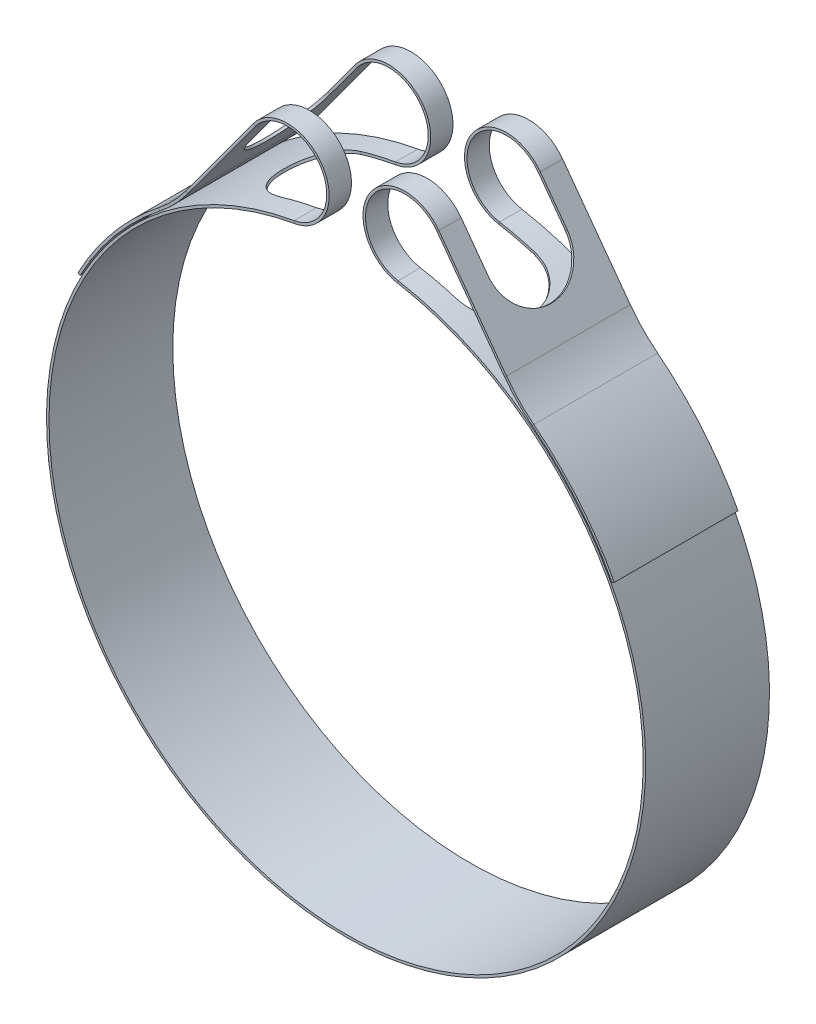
ISO-10303-21;
HEADER;
FILE_DESCRIPTION(('STEP AP214'),'2;1');
FILE_NAME('part.step','',(''),(''),'','','');
FILE_SCHEMA(('AUTOMOTIVE_DESIGN { 1 0 10303 214 1 1 1 1 }'));
ENDSEC;
DATA;
#1=APPLICATION_CONTEXT('core data for automotive mechanical design processes');
#2=APPLICATION_PROTOCOL_DEFINITION('international standard','automotive_design',2000,#1);
#3=PRODUCT_CONTEXT('',#1,'mechanical');
#4=PRODUCT('Part','Part','',(#3));
#5=PRODUCT_RELATED_PRODUCT_CATEGORY('part','',(#4));
#6=PRODUCT_DEFINITION_FORMATION('','',#4);
#7=PRODUCT_DEFINITION_CONTEXT('part definition',#1,'design');
#8=PRODUCT_DEFINITION('design','',#6,#7);
#9=PRODUCT_DEFINITION_SHAPE('','',#8);
#10=(LENGTH_UNIT() NAMED_UNIT(*) SI_UNIT(.MILLI.,.METRE.));
#11=(NAMED_UNIT(*) PLANE_ANGLE_UNIT() SI_UNIT($,.RADIAN.));
#12=(NAMED_UNIT(*) SI_UNIT($,.STERADIAN.) SOLID_ANGLE_UNIT());
#13=UNCERTAINTY_MEASURE_WITH_UNIT(LENGTH_MEASURE(1.E-05),#10,'distance_accuracy_value','');
#14=(GEOMETRIC_REPRESENTATION_CONTEXT(3) GLOBAL_UNCERTAINTY_ASSIGNED_CONTEXT((#13)) GLOBAL_UNIT_ASSIGNED_CONTEXT((#10,
#11,#12)) REPRESENTATION_CONTEXT('',''));
#15=CARTESIAN_POINT('',(0.,0.,0.));
#16=DIRECTION('',(0.,0.,1.));
#17=DIRECTION('',(1.,0.,0.));
#18=AXIS2_PLACEMENT_3D('',#15,#16,#17);
#19=CARTESIAN_POINT('',(11.8913709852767,67.4393155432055,-7.99999999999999));
#20=DIRECTION('',(0.,0.,1.));
#21=DIRECTION('',(-0.306696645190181,0.95180731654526,0.));
#22=AXIS2_PLACEMENT_3D('',#19,#20,#21);
#23=PLANE('',#22);
#24=DIRECTION('',(0.173648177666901,0.984807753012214,0.));
#25=VECTOR('',#24,1.);
#26=CARTESIAN_POINT('',(10.4188907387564,59.0884650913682,-7.99999999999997));
#27=LINE('',#26,#25);
#28=CARTESIAN_POINT('',(10.4188907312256,59.088465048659,-7.99999999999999));
#29=VERTEX_POINT('',#28);
#30=CARTESIAN_POINT('',(10.5057147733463,59.5808686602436,-7.99999999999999));
#31=VERTEX_POINT('',#30);
#32=EDGE_CURVE('E622',#29,#31,#27,.T.);
#33=ORIENTED_EDGE('',*,*,#32,.T.);
#34=CARTESIAN_POINT('',(11.8913709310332,67.4393152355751,-7.99999999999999));
#35=DIRECTION('',(0.,0.,-1.));
#36=DIRECTION('',(0.306696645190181,-0.95180731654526,0.));
#37=AXIS2_PLACEMENT_3D('',#34,#35,#36);
#38=CIRCLE('',#37,7.9796757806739);
#39=CARTESIAN_POINT('',(18.3267259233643,72.1575168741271,-7.99999999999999));
#40=VERTEX_POINT('',#39);
#41=EDGE_CURVE('E625',#31,#40,#38,.T.);
#42=ORIENTED_EDGE('',*,*,#41,.T.);
#43=DIRECTION('',(0.806468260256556,0.591277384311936,0.));
#44=VECTOR('',#43,1.);
#45=CARTESIAN_POINT('',(18.3267259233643,72.1575168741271,-7.99999999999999));
#46=LINE('',#45,#44);
#47=CARTESIAN_POINT('',(18.7299600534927,72.4531555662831,-7.99999999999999));
#48=VERTEX_POINT('',#47);
#49=EDGE_CURVE('E887',#40,#48,#46,.T.);
#50=ORIENTED_EDGE('',*,*,#49,.T.);
#51=CARTESIAN_POINT('',(11.8913709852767,67.4393155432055,-7.99999999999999));
#52=DIRECTION('',(0.,0.,-1.));
#53=DIRECTION('',(-0.306696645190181,0.95180731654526,0.));
#54=AXIS2_PLACEMENT_3D('',#51,#52,#53);
#55=CIRCLE('',#54,8.47967582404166);
#56=EDGE_CURVE('E627',#29,#48,#55,.T.);
#57=ORIENTED_EDGE('',*,*,#56,.F.);
#58=EDGE_LOOP('',(#33,#42,#50,#57));
#59=FACE_BOUND('',#58,.T.);
#60=ADVANCED_FACE('F49',(#59),#23,.T.);
#61=CARTESIAN_POINT('',(11.8913709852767,67.4393155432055,-12.5));
#62=DIRECTION('',(0.,0.,-1.));
#63=DIRECTION('',(0.306696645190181,-0.95180731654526,0.));
#64=AXIS2_PLACEMENT_3D('',#61,#62,#63);
#65=PLANE('',#64);
#66=DIRECTION('',(0.80646826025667,0.59127738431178,0.));
#67=VECTOR('',#66,1.);
#68=CARTESIAN_POINT('',(18.3267259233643,72.1575168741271,-12.5));
#69=LINE('',#68,#67);
#70=CARTESIAN_POINT('',(18.3267259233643,72.1575168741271,-12.5));
#71=VERTEX_POINT('',#70);
#72=CARTESIAN_POINT('',(18.729960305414,72.4531557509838,-12.5));
#73=VERTEX_POINT('',#72);
#74=EDGE_CURVE('E878',#71,#73,#69,.T.);
#75=ORIENTED_EDGE('',*,*,#74,.F.);
#76=CARTESIAN_POINT('',(11.8913709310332,67.4393152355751,-12.5));
#77=DIRECTION('',(0.,0.,-1.));
#78=DIRECTION('',(0.306696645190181,-0.95180731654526,0.));
#79=AXIS2_PLACEMENT_3D('',#76,#77,#78);
#80=CIRCLE('',#79,7.9796757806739);
#81=CARTESIAN_POINT('',(10.5057148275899,59.580868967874,-12.5));
#82=VERTEX_POINT('',#81);
#83=EDGE_CURVE('E869',#71,#82,#80,.F.);
#84=ORIENTED_EDGE('',*,*,#83,.T.);
#85=DIRECTION('',(0.173648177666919,0.984807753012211,0.));
#86=VECTOR('',#85,1.);
#87=CARTESIAN_POINT('',(10.4188907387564,59.0884650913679,-12.5));
#88=LINE('',#87,#86);
#89=CARTESIAN_POINT('',(10.4188907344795,59.0884651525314,-12.5));
#90=VERTEX_POINT('',#89);
#91=EDGE_CURVE('E637',#90,#82,#88,.T.);
#92=ORIENTED_EDGE('',*,*,#91,.F.);
#93=CARTESIAN_POINT('',(11.8913709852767,67.4393155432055,-12.5));
#94=DIRECTION('',(0.,0.,1.));
#95=DIRECTION('',(-0.306696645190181,0.95180731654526,0.));
#96=AXIS2_PLACEMENT_3D('',#93,#94,#95);
#97=CIRCLE('',#96,8.47967582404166);
#98=EDGE_CURVE('E867',#73,#90,#97,.T.);
#99=ORIENTED_EDGE('',*,*,#98,.F.);
#100=EDGE_LOOP('',(#75,#84,#92,#99));
#101=FACE_BOUND('',#100,.T.);
#102=ADVANCED_FACE('F612',(#101),#65,.T.);
#103=CARTESIAN_POINT('',(11.8913709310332,67.4393152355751,22.6125730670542));
#104=DIRECTION('',(0.,0.,-1.));
#105=DIRECTION('',(0.306696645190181,-0.95180731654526,0.));
#106=AXIS2_PLACEMENT_3D('',#103,#104,#105);
#107=CYLINDRICAL_SURFACE('',#106,8.4796757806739);
#108=ORIENTED_EDGE('',*,*,#98,.T.);
#109=DIRECTION('',(0.,0.,-1.));
#110=VECTOR('',#109,1.);
#111=CARTESIAN_POINT('',(10.4188907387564,59.0884650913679,12.5));
#112=LINE('',#111,#110);
#113=EDGE_CURVE('E865',#29,#90,#112,.T.);
#114=ORIENTED_EDGE('',*,*,#113,.F.);
#115=ORIENTED_EDGE('',*,*,#56,.T.);
#116=DIRECTION('',(0.,0.,-1.));
#117=VECTOR('',#116,1.);
#118=CARTESIAN_POINT('',(18.7299600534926,72.4531555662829,12.5));
#119=LINE('',#118,#117);
#120=EDGE_CURVE('E884',#48,#73,#119,.T.);
#121=ORIENTED_EDGE('',*,*,#120,.T.);
#122=EDGE_LOOP('',(#108,#114,#115,#121));
#123=FACE_BOUND('',#122,.T.);
#124=ADVANCED_FACE('F617',(#123),#107,.T.);
#125=CARTESIAN_POINT('',(11.8913709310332,67.4393152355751,22.6125730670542));
#126=DIRECTION('',(0.,0.,-1.));
#127=DIRECTION('',(0.306696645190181,-0.95180731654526,0.));
#128=AXIS2_PLACEMENT_3D('',#125,#126,#127);
#129=CYLINDRICAL_SURFACE('',#128,7.9796757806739);
#130=ORIENTED_EDGE('',*,*,#83,.F.);
#131=DIRECTION('',(0.,0.,-1.));
#132=VECTOR('',#131,1.);
#133=CARTESIAN_POINT('',(18.3267259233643,72.1575168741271,12.5));
#134=LINE('',#133,#132);
#135=EDGE_CURVE('E967',#40,#71,#134,.T.);
#136=ORIENTED_EDGE('',*,*,#135,.F.);
#137=ORIENTED_EDGE('',*,*,#41,.F.);
#138=DIRECTION('',(0.,0.,-1.));
#139=VECTOR('',#138,1.);
#140=CARTESIAN_POINT('',(10.5057148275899,59.580868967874,12.5));
#141=LINE('',#140,#139);
#142=EDGE_CURVE('E630',#31,#82,#141,.T.);
#143=ORIENTED_EDGE('',*,*,#142,.T.);
#144=EDGE_LOOP('',(#130,#136,#137,#143));
#145=FACE_BOUND('',#144,.T.);
#146=ADVANCED_FACE('F1014',(#145),#129,.F.);
#147=CARTESIAN_POINT('',(11.8913709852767,67.4393155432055,7.99999999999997));
#148=DIRECTION('',(0.,0.,-1.));
#149=DIRECTION('',(-0.95180731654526,-0.306696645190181,0.));
#150=AXIS2_PLACEMENT_3D('',#147,#148,#149);
#151=PLANE('',#150);
#152=DIRECTION('',(-0.806468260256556,-0.591277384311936,0.));
#153=VECTOR('',#152,1.);
#154=CARTESIAN_POINT('',(18.7299600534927,72.4531555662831,7.99999999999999));
#155=LINE('',#154,#153);
#156=CARTESIAN_POINT('',(18.7299600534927,72.4531555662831,7.99999999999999));
#157=VERTEX_POINT('',#156);
#158=CARTESIAN_POINT('',(18.3267259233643,72.1575168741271,7.99999999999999));
#159=VERTEX_POINT('',#158);
#160=EDGE_CURVE('E892',#157,#159,#155,.T.);
#161=ORIENTED_EDGE('',*,*,#160,.T.);
#162=CARTESIAN_POINT('',(11.8913709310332,67.4393152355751,7.99999999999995));
#163=DIRECTION('',(0.,0.,-1.));
#164=DIRECTION('',(0.306696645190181,-0.95180731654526,0.));
#165=AXIS2_PLACEMENT_3D('',#162,#163,#164);
#166=CIRCLE('',#165,7.9796757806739);
#167=CARTESIAN_POINT('',(10.5057148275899,59.580868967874,7.99999999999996));
#168=VERTEX_POINT('',#167);
#169=EDGE_CURVE('E875',#159,#168,#166,.F.);
#170=ORIENTED_EDGE('',*,*,#169,.T.);
#171=DIRECTION('',(-0.173648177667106,-0.984807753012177,0.));
#172=VECTOR('',#171,1.);
#173=CARTESIAN_POINT('',(10.5057148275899,59.580868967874,7.99999999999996));
#174=LINE('',#173,#172);
#175=CARTESIAN_POINT('',(10.4188907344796,59.0884651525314,7.99999999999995));
#176=VERTEX_POINT('',#175);
#177=EDGE_CURVE('E649',#168,#176,#174,.T.);
#178=ORIENTED_EDGE('',*,*,#177,.T.);
#179=CARTESIAN_POINT('',(11.8913709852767,67.4393155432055,7.99999999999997));
#180=DIRECTION('',(0.,0.,1.));
#181=DIRECTION('',(-0.95180731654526,-0.306696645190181,0.));
#182=AXIS2_PLACEMENT_3D('',#179,#180,#181);
#183=CIRCLE('',#182,8.47967582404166);
#184=EDGE_CURVE('E881',#157,#176,#183,.T.);
#185=ORIENTED_EDGE('',*,*,#184,.F.);
#186=EDGE_LOOP('',(#161,#170,#178,#185));
#187=FACE_BOUND('',#186,.T.);
#188=ADVANCED_FACE('F1031',(#187),#151,.T.);
#189=CARTESIAN_POINT('',(11.8913709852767,67.4393155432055,12.5));
#190=DIRECTION('',(0.,0.,1.));
#191=DIRECTION('',(-0.306696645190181,0.95180731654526,0.));
#192=AXIS2_PLACEMENT_3D('',#189,#190,#191);
#193=PLANE('',#192);
#194=DIRECTION('',(-0.173648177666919,-0.984807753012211,0.));
#195=VECTOR('',#194,1.);
#196=CARTESIAN_POINT('',(10.5057148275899,59.580868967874,12.5));
#197=LINE('',#196,#195);
#198=CARTESIAN_POINT('',(10.5057148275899,59.580868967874,12.5));
#199=VERTEX_POINT('',#198);
#200=CARTESIAN_POINT('',(10.4188907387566,59.0884650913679,12.5));
#201=VERTEX_POINT('',#200);
#202=EDGE_CURVE('E657',#199,#201,#197,.T.);
#203=ORIENTED_EDGE('',*,*,#202,.F.);
#204=CARTESIAN_POINT('',(11.8913709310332,67.4393152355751,12.5));
#205=DIRECTION('',(0.,0.,-1.));
#206=DIRECTION('',(0.306696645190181,-0.95180731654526,0.));
#207=AXIS2_PLACEMENT_3D('',#204,#205,#206);
#208=CIRCLE('',#207,7.9796757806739);
#209=CARTESIAN_POINT('',(18.3267259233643,72.1575168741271,12.5));
#210=VERTEX_POINT('',#209);
#211=EDGE_CURVE('E877',#199,#210,#208,.T.);
#212=ORIENTED_EDGE('',*,*,#211,.T.);
#213=DIRECTION('',(-0.80646826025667,-0.59127738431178,0.));
#214=VECTOR('',#213,1.);
#215=CARTESIAN_POINT('',(18.7299600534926,72.4531555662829,12.5));
#216=LINE('',#215,#214);
#217=CARTESIAN_POINT('',(18.7299605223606,72.4531559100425,12.5));
#218=VERTEX_POINT('',#217);
#219=EDGE_CURVE('E953',#218,#210,#216,.T.);
#220=ORIENTED_EDGE('',*,*,#219,.F.);
#221=CARTESIAN_POINT('',(11.8913709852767,67.4393155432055,12.5));
#222=DIRECTION('',(0.,0.,-1.));
#223=DIRECTION('',(0.306696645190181,-0.95180731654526,0.));
#224=AXIS2_PLACEMENT_3D('',#221,#222,#223);
#225=CIRCLE('',#224,8.47967582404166);
#226=EDGE_CURVE('E870',#201,#218,#225,.T.);
#227=ORIENTED_EDGE('',*,*,#226,.F.);
#228=EDGE_LOOP('',(#203,#212,#220,#227));
#229=FACE_BOUND('',#228,.T.);
#230=ADVANCED_FACE('F1038',(#229),#193,.T.);
#231=CARTESIAN_POINT('',(11.8913709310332,67.4393152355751,43.1125730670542));
#232=DIRECTION('',(0.,0.,-1.));
#233=DIRECTION('',(0.306696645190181,-0.95180731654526,0.));
#234=AXIS2_PLACEMENT_3D('',#231,#232,#233);
#235=CYLINDRICAL_SURFACE('',#234,8.4796757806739);
#236=ORIENTED_EDGE('',*,*,#226,.T.);
#237=DIRECTION('',(0.,0.,-1.));
#238=VECTOR('',#237,1.);
#239=CARTESIAN_POINT('',(18.7299600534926,72.4531555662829,12.5));
#240=LINE('',#239,#238);
#241=EDGE_CURVE('E889',#218,#157,#240,.T.);
#242=ORIENTED_EDGE('',*,*,#241,.T.);
#243=ORIENTED_EDGE('',*,*,#184,.T.);
#244=DIRECTION('',(0.,0.,-1.));
#245=VECTOR('',#244,1.);
#246=CARTESIAN_POINT('',(10.4188907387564,59.0884650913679,12.5));
#247=LINE('',#246,#245);
#248=EDGE_CURVE('E629',#201,#176,#247,.T.);
#249=ORIENTED_EDGE('',*,*,#248,.F.);
#250=EDGE_LOOP('',(#236,#242,#243,#249));
#251=FACE_BOUND('',#250,.T.);
#252=ADVANCED_FACE('F1032',(#251),#235,.T.);
#253=CARTESIAN_POINT('',(11.8913709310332,67.4393152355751,43.1125730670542));
#254=DIRECTION('',(0.,0.,-1.));
#255=DIRECTION('',(0.306696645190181,-0.95180731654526,0.));
#256=AXIS2_PLACEMENT_3D('',#253,#254,#255);
#257=CYLINDRICAL_SURFACE('',#256,7.9796757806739);
#258=ORIENTED_EDGE('',*,*,#211,.F.);
#259=DIRECTION('',(0.,0.,-1.));
#260=VECTOR('',#259,1.);
#261=CARTESIAN_POINT('',(10.5057148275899,59.580868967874,12.5));
#262=LINE('',#261,#260);
#263=EDGE_CURVE('E652',#199,#168,#262,.T.);
#264=ORIENTED_EDGE('',*,*,#263,.T.);
#265=ORIENTED_EDGE('',*,*,#169,.F.);
#266=DIRECTION('',(0.,0.,-1.));
#267=VECTOR('',#266,1.);
#268=CARTESIAN_POINT('',(18.3267259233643,72.1575168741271,12.5));
#269=LINE('',#268,#267);
#270=EDGE_CURVE('E973',#210,#159,#269,.T.);
#271=ORIENTED_EDGE('',*,*,#270,.F.);
#272=EDGE_LOOP('',(#258,#264,#265,#271));
#273=FACE_BOUND('',#272,.T.);
#274=ADVANCED_FACE('F1040',(#273),#257,.F.);
#275=CARTESIAN_POINT('',(54.1545875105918,28.6253130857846,0.));
#276=DIRECTION('',(0.467316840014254,-0.884089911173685,0.));
#277=DIRECTION('',(0.,0.,-1.));
#278=AXIS2_PLACEMENT_3D('',#275,#276,#277);
#279=PLANE('',#278);
#280=DIRECTION('',(0.884089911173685,0.467316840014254,0.));
#281=VECTOR('',#280,1.);
#282=CARTESIAN_POINT('',(54.1545875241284,28.62531309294,12.5));
#283=LINE('',#282,#281);
#284=CARTESIAN_POINT('',(53.7125425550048,28.3916546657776,12.5));
#285=VERTEX_POINT('',#284);
#286=CARTESIAN_POINT('',(54.1545875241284,28.62531309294,12.5));
#287=VERTEX_POINT('',#286);
#288=EDGE_CURVE('E908',#285,#287,#283,.T.);
#289=ORIENTED_EDGE('',*,*,#288,.F.);
#290=DIRECTION('',(0.,0.,-1.));
#291=VECTOR('',#290,1.);
#292=CARTESIAN_POINT('',(53.7125425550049,28.3916546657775,0.));
#293=LINE('',#292,#291);
#294=CARTESIAN_POINT('',(53.7125425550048,28.3916546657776,-12.5));
#295=VERTEX_POINT('',#294);
#296=EDGE_CURVE('E895',#285,#295,#293,.T.);
#297=ORIENTED_EDGE('',*,*,#296,.T.);
#298=DIRECTION('',(0.884089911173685,0.467316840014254,0.));
#299=VECTOR('',#298,1.);
#300=CARTESIAN_POINT('',(54.1545875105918,28.6253130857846,-12.5));
#301=LINE('',#300,#299);
#302=CARTESIAN_POINT('',(54.1545875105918,28.6253130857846,-12.5));
#303=VERTEX_POINT('',#302);
#304=EDGE_CURVE('E898',#295,#303,#301,.T.);
#305=ORIENTED_EDGE('',*,*,#304,.T.);
#306=DIRECTION('',(0.,0.,-1.));
#307=VECTOR('',#306,1.);
#308=CARTESIAN_POINT('',(54.1545875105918,28.6253130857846,12.5));
#309=LINE('',#308,#307);
#310=EDGE_CURVE('E916',#287,#303,#309,.T.);
#311=ORIENTED_EDGE('',*,*,#310,.F.);
#312=EDGE_LOOP('',(#289,#297,#305,#311));
#313=FACE_BOUND('',#312,.T.);
#314=ADVANCED_FACE('F508',(#313),#279,.T.);
#315=CARTESIAN_POINT('',(-7.78506148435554E-08,-4.3588917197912E-07,-12.5));
#316=DIRECTION('',(0.,0.,-1.));
#317=DIRECTION('',(0.179887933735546,0.983687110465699,0.));
#318=AXIS2_PLACEMENT_3D('',#315,#316,#317);
#319=PLANE('',#318);
#320=ORIENTED_EDGE('',*,*,#304,.F.);
#321=CARTESIAN_POINT('',(1.42824824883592E-07,-1.55697225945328E-07,-12.5));
#322=DIRECTION('',(0.,0.,-1.));
#323=DIRECTION('',(0.179887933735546,0.983687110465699,0.));
#324=AXIS2_PLACEMENT_3D('',#321,#322,#323);
#325=CIRCLE('',#324,60.7546152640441);
#326=CARTESIAN_POINT('',(37.5907430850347,47.7290190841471,-12.5));
#327=VERTEX_POINT('',#326);
#328=EDGE_CURVE('E900',#295,#327,#325,.F.);
#329=ORIENTED_EDGE('',*,*,#328,.T.);
#330=DIRECTION('',(-0.618730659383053,-0.785603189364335,0.));
#331=VECTOR('',#330,1.);
#332=CARTESIAN_POINT('',(37.9001084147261,48.1218206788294,-12.5));
#333=LINE('',#332,#331);
#334=CARTESIAN_POINT('',(37.9001081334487,48.1218204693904,-12.5));
#335=VERTEX_POINT('',#334);
#336=EDGE_CURVE('E919',#335,#327,#333,.T.);
#337=ORIENTED_EDGE('',*,*,#336,.F.);
#338=CARTESIAN_POINT('',(-7.78506148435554E-08,-4.3588917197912E-07,-12.5));
#339=DIRECTION('',(0.,0.,1.));
#340=DIRECTION('',(-0.179887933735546,-0.983687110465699,0.));
#341=AXIS2_PLACEMENT_3D('',#338,#339,#340);
#342=CIRCLE('',#341,61.2546156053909);
#343=EDGE_CURVE('E910',#303,#335,#342,.T.);
#344=ORIENTED_EDGE('',*,*,#343,.F.);
#345=EDGE_LOOP('',(#320,#329,#337,#344));
#346=FACE_BOUND('',#345,.T.);
#347=ADVANCED_FACE('F1051',(#346),#319,.T.);
#348=CARTESIAN_POINT('',(1.42824824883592E-07,-1.55697225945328E-07,35.9822879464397));
#349=DIRECTION('',(0.,0.,-1.));
#350=DIRECTION('',(0.179887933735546,0.983687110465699,0.));
#351=AXIS2_PLACEMENT_3D('',#348,#349,#350);
#352=CYLINDRICAL_SURFACE('',#351,60.7546152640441);
#353=ORIENTED_EDGE('',*,*,#328,.F.);
#354=ORIENTED_EDGE('',*,*,#296,.F.);
#355=CARTESIAN_POINT('',(1.42824824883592E-07,-1.55697225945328E-07,12.5));
#356=DIRECTION('',(0.,0.,-1.));
#357=DIRECTION('',(0.179887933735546,0.983687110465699,0.));
#358=AXIS2_PLACEMENT_3D('',#355,#356,#357);
#359=CIRCLE('',#358,60.7546152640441);
#360=CARTESIAN_POINT('',(37.5907433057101,47.7290193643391,12.5));
#361=VERTEX_POINT('',#360);
#362=EDGE_CURVE('E905',#361,#285,#359,.T.);
#363=ORIENTED_EDGE('',*,*,#362,.F.);
#364=DIRECTION('',(0.,0.,-1.));
#365=VECTOR('',#364,1.);
#366=CARTESIAN_POINT('',(37.5907430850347,47.7290190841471,12.5));
#367=LINE('',#366,#365);
#368=EDGE_CURVE('E902',#361,#327,#367,.T.);
#369=ORIENTED_EDGE('',*,*,#368,.T.);
#370=EDGE_LOOP('',(#353,#354,#363,#369));
#371=FACE_BOUND('',#370,.T.);
#372=ADVANCED_FACE('F1065',(#371),#352,.F.);
#373=CARTESIAN_POINT('',(-7.78506148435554E-08,-4.3588917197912E-07,12.5));
#374=DIRECTION('',(0.,0.,1.));
#375=DIRECTION('',(-0.179887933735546,-0.983687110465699,0.));
#376=AXIS2_PLACEMENT_3D('',#373,#374,#375);
#377=PLANE('',#376);
#378=DIRECTION('',(0.618730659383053,0.785603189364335,0.));
#379=VECTOR('',#378,1.);
#380=CARTESIAN_POINT('',(37.5907430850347,47.7290190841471,12.5));
#381=LINE('',#380,#379);
#382=CARTESIAN_POINT('',(37.9001086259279,48.1218209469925,12.5));
#383=VERTEX_POINT('',#382);
#384=EDGE_CURVE('E930',#361,#383,#381,.T.);
#385=ORIENTED_EDGE('',*,*,#384,.F.);
#386=ORIENTED_EDGE('',*,*,#362,.T.);
#387=ORIENTED_EDGE('',*,*,#288,.T.);
#388=CARTESIAN_POINT('',(-7.78506148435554E-08,-4.3588917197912E-07,12.5));
#389=DIRECTION('',(0.,0.,-1.));
#390=DIRECTION('',(0.179887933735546,0.983687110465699,0.));
#391=AXIS2_PLACEMENT_3D('',#388,#389,#390);
#392=CIRCLE('',#391,61.2546156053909);
#393=EDGE_CURVE('E913',#383,#287,#392,.T.);
#394=ORIENTED_EDGE('',*,*,#393,.F.);
#395=EDGE_LOOP('',(#385,#386,#387,#394));
#396=FACE_BOUND('',#395,.T.);
#397=ADVANCED_FACE('F1063',(#396),#377,.T.);
#398=CARTESIAN_POINT('',(1.42824824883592E-07,-1.55697225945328E-07,35.9822879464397));
#399=DIRECTION('',(0.,0.,-1.));
#400=DIRECTION('',(0.179887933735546,0.983687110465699,0.));
#401=AXIS2_PLACEMENT_3D('',#398,#399,#400);
#402=CYLINDRICAL_SURFACE('',#401,61.2546152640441);
#403=ORIENTED_EDGE('',*,*,#343,.T.);
#404=DIRECTION('',(0.,0.,-1.));
#405=VECTOR('',#404,1.);
#406=CARTESIAN_POINT('',(37.9001084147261,48.1218206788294,12.5));
#407=LINE('',#406,#405);
#408=EDGE_CURVE('E939',#383,#335,#407,.T.);
#409=ORIENTED_EDGE('',*,*,#408,.F.);
#410=ORIENTED_EDGE('',*,*,#393,.T.);
#411=ORIENTED_EDGE('',*,*,#310,.T.);
#412=EDGE_LOOP('',(#403,#409,#410,#411));
#413=FACE_BOUND('',#412,.T.);
#414=ADVANCED_FACE('F1055',(#413),#402,.T.);
#415=CARTESIAN_POINT('',(56.0964111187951,71.225691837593,-12.5));
#416=DIRECTION('',(0.,0.,1.));
#417=DIRECTION('',(-0.43667657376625,-0.899618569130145,0.));
#418=AXIS2_PLACEMENT_3D('',#415,#416,#417);
#419=PLANE('',#418);
#420=ORIENTED_EDGE('',*,*,#336,.T.);
#421=CARTESIAN_POINT('',(56.0964108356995,71.225691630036,-12.5));
#422=DIRECTION('',(0.,0.,-1.));
#423=DIRECTION('',(0.43667657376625,0.899618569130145,0.));
#424=AXIS2_PLACEMENT_3D('',#421,#422,#423);
#425=CIRCLE('',#424,29.909085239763);
#426=CARTESIAN_POINT('',(31.9756831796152,53.5411261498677,-12.5));
#427=VERTEX_POINT('',#426);
#428=EDGE_CURVE('E922',#327,#427,#425,.T.);
#429=ORIENTED_EDGE('',*,*,#428,.T.);
#430=DIRECTION('',(-0.806468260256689,-0.591277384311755,0.));
#431=VECTOR('',#430,1.);
#432=CARTESIAN_POINT('',(32.3789173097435,53.8367648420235,-12.5));
#433=LINE('',#432,#431);
#434=CARTESIAN_POINT('',(32.3789170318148,53.8367646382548,-12.5));
#435=VERTEX_POINT('',#434);
#436=EDGE_CURVE('E989',#435,#427,#433,.T.);
#437=ORIENTED_EDGE('',*,*,#436,.F.);
#438=CARTESIAN_POINT('',(56.0964111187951,71.225691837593,-12.5));
#439=DIRECTION('',(0.,0.,-1.));
#440=DIRECTION('',(0.43667657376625,0.899618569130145,0.));
#441=AXIS2_PLACEMENT_3D('',#438,#439,#440);
#442=CIRCLE('',#441,29.4090855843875);
#443=EDGE_CURVE('E933',#335,#435,#442,.T.);
#444=ORIENTED_EDGE('',*,*,#443,.F.);
#445=EDGE_LOOP('',(#420,#429,#437,#444));
#446=FACE_BOUND('',#445,.T.);
#447=ADVANCED_FACE('F1047',(#446),#419,.F.);
#448=CARTESIAN_POINT('',(56.0964108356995,71.225691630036,26.3914570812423));
#449=DIRECTION('',(0.,0.,-1.));
#450=DIRECTION('',(0.43667657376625,0.899618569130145,0.));
#451=AXIS2_PLACEMENT_3D('',#448,#449,#450);
#452=CYLINDRICAL_SURFACE('',#451,29.909085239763);
#453=ORIENTED_EDGE('',*,*,#428,.F.);
#454=ORIENTED_EDGE('',*,*,#368,.F.);
#455=CARTESIAN_POINT('',(56.0964108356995,71.225691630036,12.5));
#456=DIRECTION('',(0.,0.,-1.));
#457=DIRECTION('',(0.43667657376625,0.899618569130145,0.));
#458=AXIS2_PLACEMENT_3D('',#455,#456,#457);
#459=CIRCLE('',#458,29.909085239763);
#460=CARTESIAN_POINT('',(31.9756828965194,53.5411259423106,12.5));
#461=VERTEX_POINT('',#460);
#462=EDGE_CURVE('E927',#461,#361,#459,.F.);
#463=ORIENTED_EDGE('',*,*,#462,.F.);
#464=DIRECTION('',(0.,0.,-1.));
#465=VECTOR('',#464,1.);
#466=CARTESIAN_POINT('',(31.9756831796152,53.5411261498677,12.5));
#467=LINE('',#466,#465);
#468=EDGE_CURVE('E925',#461,#427,#467,.T.);
#469=ORIENTED_EDGE('',*,*,#468,.T.);
#470=EDGE_LOOP('',(#453,#454,#463,#469));
#471=FACE_BOUND('',#470,.T.);
#472=ADVANCED_FACE('F1044',(#471),#452,.T.);
#473=CARTESIAN_POINT('',(56.0964111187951,71.225691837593,12.5));
#474=DIRECTION('',(0.,0.,-1.));
#475=DIRECTION('',(0.43667657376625,0.899618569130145,0.));
#476=AXIS2_PLACEMENT_3D('',#473,#474,#475);
#477=PLANE('',#476);
#478=DIRECTION('',(0.806468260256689,0.591277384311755,0.));
#479=VECTOR('',#478,1.);
#480=CARTESIAN_POINT('',(31.9756831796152,53.5411261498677,12.5));
#481=LINE('',#480,#479);
#482=CARTESIAN_POINT('',(32.3789170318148,53.8367646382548,12.5));
#483=VERTEX_POINT('',#482);
#484=EDGE_CURVE('E959',#461,#483,#481,.T.);
#485=ORIENTED_EDGE('',*,*,#484,.F.);
#486=ORIENTED_EDGE('',*,*,#462,.T.);
#487=ORIENTED_EDGE('',*,*,#384,.T.);
#488=CARTESIAN_POINT('',(56.0964111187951,71.225691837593,12.5));
#489=DIRECTION('',(0.,0.,1.));
#490=DIRECTION('',(-0.43667657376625,-0.899618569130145,0.));
#491=AXIS2_PLACEMENT_3D('',#488,#489,#490);
#492=CIRCLE('',#491,29.4090855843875);
#493=EDGE_CURVE('E936',#483,#383,#492,.T.);
#494=ORIENTED_EDGE('',*,*,#493,.F.);
#495=EDGE_LOOP('',(#485,#486,#487,#494));
#496=FACE_BOUND('',#495,.T.);
#497=ADVANCED_FACE('F1060',(#496),#477,.F.);
#498=CARTESIAN_POINT('',(56.0964108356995,71.225691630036,26.3914570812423));
#499=DIRECTION('',(0.,0.,-1.));
#500=DIRECTION('',(0.43667657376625,0.899618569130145,0.));
#501=AXIS2_PLACEMENT_3D('',#498,#499,#500);
#502=CYLINDRICAL_SURFACE('',#501,29.409085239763);
#503=ORIENTED_EDGE('',*,*,#443,.T.);
#504=DIRECTION('',(0.,0.,-1.));
#505=VECTOR('',#504,1.);
#506=CARTESIAN_POINT('',(32.3789173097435,53.8367648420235,12.5));
#507=LINE('',#506,#505);
#508=EDGE_CURVE('E950',#483,#435,#507,.T.);
#509=ORIENTED_EDGE('',*,*,#508,.F.);
#510=ORIENTED_EDGE('',*,*,#493,.T.);
#511=ORIENTED_EDGE('',*,*,#408,.T.);
#512=EDGE_LOOP('',(#503,#509,#510,#511));
#513=FACE_BOUND('',#512,.T.);
#514=ADVANCED_FACE('F1058',(#513),#502,.F.);
#515=CARTESIAN_POINT('',(-154.463463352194,-65.980336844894,0.));
#516=DIRECTION('',(0.806468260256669,0.591277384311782,0.));
#517=DIRECTION('',(-0.591277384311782,0.806468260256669,0.));
#518=AXIS2_PLACEMENT_3D('',#515,#516,#517);
#519=CYLINDRICAL_SURFACE('',#518,8.);
#520=DIRECTION('',(0.806468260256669,0.591277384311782,0.));
#521=VECTOR('',#520,1.);
#522=CARTESIAN_POINT('',(-154.463463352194,-65.980336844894,8.));
#523=LINE('',#522,#521);
#524=CARTESIAN_POINT('',(23.7882743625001,64.7082797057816,8.));
#525=VERTEX_POINT('',#524);
#526=CARTESIAN_POINT('',(24.1915084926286,65.0039183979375,8.));
#527=VERTEX_POINT('',#526);
#528=EDGE_CURVE('E942',#525,#527,#523,.T.);
#529=ORIENTED_EDGE('',*,*,#528,.T.);
#530=CARTESIAN_POINT('',(24.1915084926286,65.0039183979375,0.));
#531=DIRECTION('',(0.806468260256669,0.591277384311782,0.));
#532=DIRECTION('',(-0.591277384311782,0.806468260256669,0.));
#533=AXIS2_PLACEMENT_3D('',#530,#531,#532);
#534=CIRCLE('',#533,8.);
#535=CARTESIAN_POINT('',(24.1915084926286,65.0039183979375,-8.));
#536=VERTEX_POINT('',#535);
#537=EDGE_CURVE('E944',#527,#536,#534,.T.);
#538=ORIENTED_EDGE('',*,*,#537,.T.);
#539=DIRECTION('',(0.806468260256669,0.591277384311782,0.));
#540=VECTOR('',#539,1.);
#541=CARTESIAN_POINT('',(-154.463463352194,-65.980336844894,-8.));
#542=LINE('',#541,#540);
#543=CARTESIAN_POINT('',(23.7882743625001,64.7082797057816,-8.));
#544=VERTEX_POINT('',#543);
#545=EDGE_CURVE('E982',#544,#536,#542,.T.);
#546=ORIENTED_EDGE('',*,*,#545,.F.);
#547=CARTESIAN_POINT('',(23.7882743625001,64.7082797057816,0.));
#548=DIRECTION('',(0.806468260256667,0.591277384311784,0.));
#549=DIRECTION('',(-0.591277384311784,0.806468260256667,0.));
#550=AXIS2_PLACEMENT_3D('',#547,#548,#549);
#551=CIRCLE('',#550,8.);
#552=EDGE_CURVE('E962',#525,#544,#551,.T.);
#553=ORIENTED_EDGE('',*,*,#552,.F.);
#554=EDGE_LOOP('',(#529,#538,#546,#553));
#555=FACE_BOUND('',#554,.T.);
#556=ADVANCED_FACE('F1025',(#555),#519,.F.);
#557=CARTESIAN_POINT('',(18.7299600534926,72.4531555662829,12.5));
#558=DIRECTION('',(0.806468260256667,0.591277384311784,0.));
#559=DIRECTION('',(-0.591277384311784,0.806468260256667,0.));
#560=AXIS2_PLACEMENT_3D('',#557,#558,#559);
#561=PLANE('',#560);
#562=DIRECTION('',(-0.591277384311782,0.806468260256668,0.));
#563=VECTOR('',#562,1.);
#564=CARTESIAN_POINT('',(24.1915084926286,65.0039183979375,-8.));
#565=LINE('',#564,#563);
#566=EDGE_CURVE('E984',#536,#48,#565,.T.);
#567=ORIENTED_EDGE('',*,*,#566,.F.);
#568=ORIENTED_EDGE('',*,*,#537,.F.);
#569=DIRECTION('',(0.591277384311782,-0.806468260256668,0.));
#570=VECTOR('',#569,1.);
#571=CARTESIAN_POINT('',(24.1915084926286,65.0039183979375,8.));
#572=LINE('',#571,#570);
#573=EDGE_CURVE('E979',#157,#527,#572,.T.);
#574=ORIENTED_EDGE('',*,*,#573,.F.);
#575=ORIENTED_EDGE('',*,*,#241,.F.);
#576=DIRECTION('',(0.591277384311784,-0.806468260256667,0.));
#577=VECTOR('',#576,1.);
#578=CARTESIAN_POINT('',(18.7299600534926,72.4531555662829,12.5));
#579=LINE('',#578,#577);
#580=EDGE_CURVE('E947',#218,#483,#579,.T.);
#581=ORIENTED_EDGE('',*,*,#580,.T.);
#582=ORIENTED_EDGE('',*,*,#508,.T.);
#583=DIRECTION('',(0.591277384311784,-0.806468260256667,0.));
#584=VECTOR('',#583,1.);
#585=CARTESIAN_POINT('',(18.7299600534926,72.4531555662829,-12.5));
#586=LINE('',#585,#584);
#587=EDGE_CURVE('E986',#73,#435,#586,.T.);
#588=ORIENTED_EDGE('',*,*,#587,.F.);
#589=ORIENTED_EDGE('',*,*,#120,.F.);
#590=EDGE_LOOP('',(#567,#568,#574,#575,#581,#582,#588,#589));
#591=FACE_BOUND('',#590,.T.);
#592=ADVANCED_FACE('F1006',(#591),#561,.T.);
#593=CARTESIAN_POINT('',(10.5057148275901,59.580868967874,12.5));
#594=DIRECTION('',(0.,0.,1.));
#595=DIRECTION('',(1.,0.,0.));
#596=AXIS2_PLACEMENT_3D('',#593,#594,#595);
#597=PLANE('',#596);
#598=ORIENTED_EDGE('',*,*,#580,.F.);
#599=ORIENTED_EDGE('',*,*,#219,.T.);
#600=DIRECTION('',(0.591277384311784,-0.806468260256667,0.));
#601=VECTOR('',#600,1.);
#602=CARTESIAN_POINT('',(18.3267259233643,72.1575168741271,12.5));
#603=LINE('',#602,#601);
#604=EDGE_CURVE('E956',#210,#461,#603,.T.);
#605=ORIENTED_EDGE('',*,*,#604,.T.);
#606=ORIENTED_EDGE('',*,*,#484,.T.);
#607=EDGE_LOOP('',(#598,#599,#605,#606));
#608=FACE_BOUND('',#607,.T.);
#609=ADVANCED_FACE('F1036',(#608),#597,.T.);
#610=CARTESIAN_POINT('',(18.3267259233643,72.1575168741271,12.5));
#611=DIRECTION('',(0.806468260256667,0.591277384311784,0.));
#612=DIRECTION('',(-0.591277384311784,0.806468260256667,0.));
#613=AXIS2_PLACEMENT_3D('',#610,#611,#612);
#614=PLANE('',#613);
#615=ORIENTED_EDGE('',*,*,#552,.T.);
#616=DIRECTION('',(-0.591277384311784,0.806468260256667,0.));
#617=VECTOR('',#616,1.);
#618=CARTESIAN_POINT('',(18.3267259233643,72.1575168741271,-7.99999999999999));
#619=LINE('',#618,#617);
#620=EDGE_CURVE('E965',#544,#40,#619,.T.);
#621=ORIENTED_EDGE('',*,*,#620,.T.);
#622=ORIENTED_EDGE('',*,*,#135,.T.);
#623=DIRECTION('',(0.591277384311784,-0.806468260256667,0.));
#624=VECTOR('',#623,1.);
#625=CARTESIAN_POINT('',(18.3267259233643,72.1575168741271,-12.5));
#626=LINE('',#625,#624);
#627=EDGE_CURVE('E970',#71,#427,#626,.T.);
#628=ORIENTED_EDGE('',*,*,#627,.T.);
#629=ORIENTED_EDGE('',*,*,#468,.F.);
#630=ORIENTED_EDGE('',*,*,#604,.F.);
#631=ORIENTED_EDGE('',*,*,#270,.T.);
#632=DIRECTION('',(0.591277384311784,-0.806468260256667,0.));
#633=VECTOR('',#632,1.);
#634=CARTESIAN_POINT('',(18.3267259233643,72.1575168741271,7.99999999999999));
#635=LINE('',#634,#633);
#636=EDGE_CURVE('E976',#159,#525,#635,.T.);
#637=ORIENTED_EDGE('',*,*,#636,.T.);
#638=EDGE_LOOP('',(#615,#621,#622,#628,#629,#630,#631,#637));
#639=FACE_BOUND('',#638,.T.);
#640=ADVANCED_FACE('F1016',(#639),#614,.F.);
#641=CARTESIAN_POINT('',(-154.463463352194,-65.980336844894,8.));
#642=DIRECTION('',(0.,0.,1.));
#643=DIRECTION('',(-0.899618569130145,0.43667657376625,0.));
#644=AXIS2_PLACEMENT_3D('',#641,#642,#643);
#645=PLANE('',#644);
#646=ORIENTED_EDGE('',*,*,#160,.F.);
#647=ORIENTED_EDGE('',*,*,#573,.T.);
#648=ORIENTED_EDGE('',*,*,#528,.F.);
#649=ORIENTED_EDGE('',*,*,#636,.F.);
#650=EDGE_LOOP('',(#646,#647,#648,#649));
#651=FACE_BOUND('',#650,.T.);
#652=ADVANCED_FACE('F1028',(#651),#645,.F.);
#653=CARTESIAN_POINT('',(-154.463463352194,-65.980336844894,-8.));
#654=DIRECTION('',(0.,0.,-1.));
#655=DIRECTION('',(0.899618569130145,-0.43667657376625,0.));
#656=AXIS2_PLACEMENT_3D('',#653,#654,#655);
#657=PLANE('',#656);
#658=ORIENTED_EDGE('',*,*,#49,.F.);
#659=ORIENTED_EDGE('',*,*,#620,.F.);
#660=ORIENTED_EDGE('',*,*,#545,.T.);
#661=ORIENTED_EDGE('',*,*,#566,.T.);
#662=EDGE_LOOP('',(#658,#659,#660,#661));
#663=FACE_BOUND('',#662,.T.);
#664=ADVANCED_FACE('F1021',(#663),#657,.F.);
#665=CARTESIAN_POINT('',(7.87410865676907E-08,-8.93647031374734E-08,-12.5));
#666=DIRECTION('',(0.,0.,1.));
#667=DIRECTION('',(1.,0.,0.));
#668=AXIS2_PLACEMENT_3D('',#665,#666,#667);
#669=PLANE('',#668);
#670=ORIENTED_EDGE('',*,*,#587,.T.);
#671=ORIENTED_EDGE('',*,*,#436,.T.);
#672=ORIENTED_EDGE('',*,*,#627,.F.);
#673=ORIENTED_EDGE('',*,*,#74,.T.);
#674=EDGE_LOOP('',(#670,#671,#672,#673));
#675=FACE_BOUND('',#674,.T.);
#676=ADVANCED_FACE('F609',(#675),#669,.F.);
#677=CARTESIAN_POINT('',(7.44642195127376E-08,-1.50528249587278E-07,-8.00000000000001));
#678=DIRECTION('',(0.,0.,-1.));
#679=DIRECTION('',(0.613737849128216,-0.789509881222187,0.));
#680=AXIS2_PLACEMENT_3D('',#677,#678,#679);
#681=PLANE('',#680);
#682=CARTESIAN_POINT('',(17.6385992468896,57.8716667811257,-7.99999999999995));
#683=CARTESIAN_POINT('',(17.4928257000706,57.3933885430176,-7.99999999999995));
#684=B_SPLINE_CURVE_WITH_KNOTS('',1,(#682,#683),.UNSPECIFIED.,.F.,.F.,(2,2),(0.,1.),.UNSPECIFIED.);
#685=CARTESIAN_POINT('',(17.6385992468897,57.8716667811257,-8.00000000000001));
#686=VERTEX_POINT('',#685);
#687=CARTESIAN_POINT('',(17.4928257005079,57.3933885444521,-8.00000000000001));
#688=VERTEX_POINT('',#687);
#689=EDGE_CURVE('E537',#686,#688,#684,.T.);
#690=ORIENTED_EDGE('',*,*,#689,.F.);
#691=CARTESIAN_POINT('',(6.3679429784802E-08,-8.93647100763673E-08,-8.00000000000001));
#692=DIRECTION('',(0.,0.,-1.));
#693=DIRECTION('',(0.613737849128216,-0.789509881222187,0.));
#694=AXIS2_PLACEMENT_3D('',#691,#692,#693);
#695=CIRCLE('',#694,60.5000000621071);
#696=EDGE_CURVE('E351',#686,#31,#695,.F.);
#697=ORIENTED_EDGE('',*,*,#696,.T.);
#698=ORIENTED_EDGE('',*,*,#32,.F.);
#699=CARTESIAN_POINT('',(7.44642195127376E-08,-1.50528249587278E-07,-8.00000000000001));
#700=DIRECTION('',(0.,0.,1.));
#701=DIRECTION('',(0.613737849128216,-0.789509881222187,0.));
#702=AXIS2_PLACEMENT_3D('',#699,#700,#701);
#703=CIRCLE('',#702,60.0000001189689);
#704=EDGE_CURVE('E404',#688,#29,#703,.T.);
#705=ORIENTED_EDGE('',*,*,#704,.F.);
#706=EDGE_LOOP('',(#690,#697,#698,#705));
#707=FACE_BOUND('',#706,.T.);
#708=ADVANCED_FACE('F505',(#707),#681,.F.);
#709=CARTESIAN_POINT('',(7.44642195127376E-08,-1.50528249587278E-07,-12.5));
#710=DIRECTION('',(0.,0.,1.));
#711=DIRECTION('',(-0.613737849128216,0.789509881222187,0.));
#712=AXIS2_PLACEMENT_3D('',#709,#710,#711);
#713=PLANE('',#712);
#714=ORIENTED_EDGE('',*,*,#91,.T.);
#715=CARTESIAN_POINT('',(6.3679429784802E-08,-8.93647100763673E-08,-12.5));
#716=DIRECTION('',(0.,0.,-1.));
#717=DIRECTION('',(0.613737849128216,-0.789509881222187,0.));
#718=AXIS2_PLACEMENT_3D('',#715,#716,#717);
#719=CIRCLE('',#718,60.5000000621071);
#720=CARTESIAN_POINT('',(-10.5057146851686,59.5808689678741,-12.5));
#721=VERTEX_POINT('',#720);
#722=EDGE_CURVE('E415',#82,#721,#719,.T.);
#723=ORIENTED_EDGE('',*,*,#722,.T.);
#724=DIRECTION('',(-0.173648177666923,0.984807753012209,0.));
#725=VECTOR('',#724,1.);
#726=CARTESIAN_POINT('',(-10.4188905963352,59.088465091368,-12.5));
#727=LINE('',#726,#725);
#728=CARTESIAN_POINT('',(-10.4188906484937,59.0884651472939,-12.5));
#729=VERTEX_POINT('',#728);
#730=EDGE_CURVE('E850',#729,#721,#727,.T.);
#731=ORIENTED_EDGE('',*,*,#730,.F.);
#732=CARTESIAN_POINT('',(7.44642195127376E-08,-1.50528249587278E-07,-12.5));
#733=DIRECTION('',(0.,0.,-1.));
#734=DIRECTION('',(0.613737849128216,-0.789509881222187,0.));
#735=AXIS2_PLACEMENT_3D('',#732,#733,#734);
#736=CIRCLE('',#735,60.0000001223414);
#737=EDGE_CURVE('E400',#90,#729,#736,.T.);
#738=ORIENTED_EDGE('',*,*,#737,.F.);
#739=EDGE_LOOP('',(#714,#723,#731,#738));
#740=FACE_BOUND('',#739,.T.);
#741=ADVANCED_FACE('F603',(#740),#713,.F.);
#742=CARTESIAN_POINT('',(7.44642195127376E-08,-1.50528249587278E-07,-7.99999999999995));
#743=DIRECTION('',(0.,0.,-1.));
#744=DIRECTION('',(0.613737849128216,-0.789509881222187,0.));
#745=AXIS2_PLACEMENT_3D('',#742,#743,#744);
#746=PLANE('',#745);
#747=DIRECTION('',(-0.173648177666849,0.984807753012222,0.));
#748=VECTOR('',#747,1.);
#749=CARTESIAN_POINT('',(-10.4188905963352,59.088465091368,-8.));
#750=LINE('',#749,#748);
#751=CARTESIAN_POINT('',(-10.41889060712,59.0884651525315,-8.00000000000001));
#752=VERTEX_POINT('',#751);
#753=CARTESIAN_POINT('',(-10.5057146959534,59.5808690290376,-8.00000000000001));
#754=VERTEX_POINT('',#753);
#755=EDGE_CURVE('E834',#752,#754,#750,.T.);
#756=ORIENTED_EDGE('',*,*,#755,.T.);
#757=CARTESIAN_POINT('',(6.3679429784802E-08,-8.93647100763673E-08,-8.00000000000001));
#758=DIRECTION('',(0.,0.,-1.));
#759=DIRECTION('',(0.613737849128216,-0.789509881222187,0.));
#760=AXIS2_PLACEMENT_3D('',#757,#758,#759);
#761=CIRCLE('',#760,60.5000000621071);
#762=CARTESIAN_POINT('',(-17.6385991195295,57.8716667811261,-8.00000000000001));
#763=VERTEX_POINT('',#762);
#764=EDGE_CURVE('E417',#754,#763,#761,.F.);
#765=ORIENTED_EDGE('',*,*,#764,.T.);
#766=CARTESIAN_POINT('',(-17.4928255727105,57.3933885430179,-7.99999999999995));
#767=CARTESIAN_POINT('',(-17.6385991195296,57.8716667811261,-7.99999999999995));
#768=B_SPLINE_CURVE_WITH_KNOTS('',1,(#766,#767),.UNSPECIFIED.,.F.,.F.,(2,2),(0.,1.),.UNSPECIFIED.);
#769=CARTESIAN_POINT('',(-17.4928255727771,57.3933885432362,-7.99999999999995));
#770=VERTEX_POINT('',#769);
#771=EDGE_CURVE('E590',#763,#770,#768,.F.);
#772=ORIENTED_EDGE('',*,*,#771,.T.);
#773=CARTESIAN_POINT('',(7.44642195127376E-08,-1.50528249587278E-07,-7.99999999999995));
#774=DIRECTION('',(0.,0.,1.));
#775=DIRECTION('',(0.613737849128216,-0.789509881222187,0.));
#776=AXIS2_PLACEMENT_3D('',#773,#774,#775);
#777=CIRCLE('',#776,60.000000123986);
#778=EDGE_CURVE('E403',#752,#770,#777,.T.);
#779=ORIENTED_EDGE('',*,*,#778,.F.);
#780=EDGE_LOOP('',(#756,#765,#772,#779));
#781=FACE_BOUND('',#780,.T.);
#782=ADVANCED_FACE('F595',(#781),#746,.F.);
#783=CARTESIAN_POINT('',(-17.6385991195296,57.8716667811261,-7.99999999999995));
#784=CARTESIAN_POINT('',(-18.7047102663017,57.546728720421,-7.99654787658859));
#785=CARTESIAN_POINT('',(-19.6819410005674,57.2168623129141,-7.799064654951));
#786=CARTESIAN_POINT('',(-21.0187791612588,56.7334597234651,-7.21179262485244));
#787=CARTESIAN_POINT('',(-21.4428913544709,56.5741916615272,-6.96752744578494));
#788=CARTESIAN_POINT('',(-22.2488857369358,56.2620994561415,-6.3819814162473));
#789=CARTESIAN_POINT('',(-22.630049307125,56.1095707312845,-6.04147712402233));
#790=CARTESIAN_POINT('',(-23.7156946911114,55.6635255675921,-4.86978139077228));
#791=CARTESIAN_POINT('',(-24.2529996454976,55.4273850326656,-4.0083134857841));
#792=CARTESIAN_POINT('',(-24.9676748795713,55.1091481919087,-2.1247028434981));
#793=CARTESIAN_POINT('',(-25.1451130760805,55.0270232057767,-1.10322908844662));
#794=CARTESIAN_POINT('',(-25.1448532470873,55.0271419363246,1.10306918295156));
#795=CARTESIAN_POINT('',(-24.9672921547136,55.1093214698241,2.12557987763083));
#796=CARTESIAN_POINT('',(-24.4313067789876,55.3479854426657,3.53838825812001));
#797=CARTESIAN_POINT('',(-24.2076308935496,55.4466107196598,3.98916477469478));
#798=CARTESIAN_POINT('',(-23.8035509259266,55.6207017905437,4.63509013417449));
#799=CARTESIAN_POINT('',(-23.6574259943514,55.683080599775,4.84535868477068));
#800=CARTESIAN_POINT('',(-23.4209281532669,55.7827700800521,5.15320165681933));
#801=CARTESIAN_POINT('',(-23.3392102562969,55.8170194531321,5.25455600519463));
#802=CARTESIAN_POINT('',(-23.2122833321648,55.8698666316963,5.40469756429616));
#803=CARTESIAN_POINT('',(-23.1692493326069,55.8877278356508,5.45442975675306));
#804=CARTESIAN_POINT('',(-23.1036079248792,55.9148804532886,5.52855555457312));
#805=CARTESIAN_POINT('',(-23.0815457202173,55.9239914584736,5.55318540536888));
#806=CARTESIAN_POINT('',(-23.0481794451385,55.9377472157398,5.59001205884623));
#807=CARTESIAN_POINT('',(-23.037011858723,55.9423473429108,5.60226792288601));
#808=CARTESIAN_POINT('',(-23.0145856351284,55.9515771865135,5.62674027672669));
#809=CARTESIAN_POINT('',(-23.0027824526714,55.9564306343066,5.63954431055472));
#810=CARTESIAN_POINT('',(-22.6477140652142,56.1023136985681,6.02264984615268));
#811=CARTESIAN_POINT('',(-22.2733392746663,56.2524406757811,6.35340489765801));
#812=CARTESIAN_POINT('',(-21.665752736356,56.4879839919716,6.7884256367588));
#813=CARTESIAN_POINT('',(-21.4555525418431,56.5682193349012,6.92324724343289));
#814=CARTESIAN_POINT('',(-21.1286258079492,56.6907815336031,7.11020169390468));
#815=CARTESIAN_POINT('',(-21.0177124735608,56.7320035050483,7.16997351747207));
#816=CARTESIAN_POINT('',(-20.8484208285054,56.7943391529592,7.25581176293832));
#817=CARTESIAN_POINT('',(-20.7915033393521,56.8152014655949,7.28378792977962));
#818=CARTESIAN_POINT('',(-20.7053948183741,56.8466142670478,7.32479730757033));
#819=CARTESIAN_POINT('',(-20.6765699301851,56.8571050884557,7.33830795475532));
#820=CARTESIAN_POINT('',(-20.6331492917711,56.8728703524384,7.35833520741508));
#821=CARTESIAN_POINT('',(-20.6186451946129,56.8781302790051,7.36497117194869));
#822=CARTESIAN_POINT('',(-20.5968431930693,56.8860273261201,7.37486543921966));
#823=CARTESIAN_POINT('',(-20.5895682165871,56.8886608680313,7.37815358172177));
#824=CARTESIAN_POINT('',(-20.5786442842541,56.8926129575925,7.38307087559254));
#825=CARTESIAN_POINT('',(-20.5750010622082,56.893930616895,7.38470748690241));
#826=CARTESIAN_POINT('',(-20.5677107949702,56.8965665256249,7.38797573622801));
#827=CARTESIAN_POINT('',(-20.5632397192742,56.8981825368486,7.3899752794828));
#828=CARTESIAN_POINT('',(-19.8372335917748,57.1605234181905,7.71411553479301));
#829=CARTESIAN_POINT('',(-18.8671210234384,57.4972278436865,7.9170295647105));
#830=CARTESIAN_POINT('',(-17.6385991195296,57.8716667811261,8.00000000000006));
#831=CARTESIAN_POINT('',(-17.4928255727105,57.3933885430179,-7.99999999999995));
#832=CARTESIAN_POINT('',(-18.550125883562,57.0711359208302,-7.99654787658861));
#833=CARTESIAN_POINT('',(-19.519280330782,56.7439956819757,-7.799064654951));
#834=CARTESIAN_POINT('',(-20.8450702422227,56.2645881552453,-7.21179262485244));
#835=CARTESIAN_POINT('',(-21.2656773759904,56.1066363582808,-6.96752744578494));
#836=CARTESIAN_POINT('',(-22.0650106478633,55.7971234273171,-6.3819814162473));
#837=CARTESIAN_POINT('',(-22.4430241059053,55.6458552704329,-6.04147712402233));
#838=CARTESIAN_POINT('',(-23.5196972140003,55.2034964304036,-4.86978139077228));
#839=CARTESIAN_POINT('',(-24.0525616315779,54.9693074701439,-4.0083134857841));
#840=CARTESIAN_POINT('',(-24.7613304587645,54.6537006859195,-2.1247028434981));
#841=CARTESIAN_POINT('',(-24.9373022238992,54.5722544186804,-1.10322908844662));
#842=CARTESIAN_POINT('',(-24.9370445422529,54.5723721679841,1.10306918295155));
#843=CARTESIAN_POINT('',(-24.7609508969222,54.653872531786,2.12557987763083));
#844=CARTESIAN_POINT('',(-24.229395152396,54.8905640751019,3.53838825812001));
#845=CARTESIAN_POINT('',(-24.0075678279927,54.9883742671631,3.98916477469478));
#846=CARTESIAN_POINT('',(-23.606827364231,55.1610265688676,4.63509013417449));
#847=CARTESIAN_POINT('',(-23.4619100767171,55.2228898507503,4.84535868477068));
#848=CARTESIAN_POINT('',(-23.2273667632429,55.321755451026,5.15320165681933));
#849=CARTESIAN_POINT('',(-23.1463242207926,55.3557217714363,5.25455600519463));
#850=CARTESIAN_POINT('',(-23.0204462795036,55.4081321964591,5.40469756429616));
#851=CARTESIAN_POINT('',(-22.9777679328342,55.4258457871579,5.45442975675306));
#852=CARTESIAN_POINT('',(-22.9126690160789,55.4527740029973,5.52855555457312));
#853=CARTESIAN_POINT('',(-22.8907891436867,55.4618097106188,5.55318540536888));
#854=CARTESIAN_POINT('',(-22.8576986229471,55.4754517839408,5.59001205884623));
#855=CARTESIAN_POINT('',(-22.8466233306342,55.4800138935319,5.60226792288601));
#856=CARTESIAN_POINT('',(-22.8243824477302,55.4891674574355,5.62674027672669));
#857=CARTESIAN_POINT('',(-22.8126768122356,55.4939807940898,5.63954431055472));
#858=CARTESIAN_POINT('',(-22.4605428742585,55.6386582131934,6.02264984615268));
#859=CARTESIAN_POINT('',(-22.0892620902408,55.7875444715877,6.35340489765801));
#860=CARTESIAN_POINT('',(-21.4866969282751,56.0211411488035,6.7884256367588));
#861=CARTESIAN_POINT('',(-21.2782339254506,56.100713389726,6.92324724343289));
#862=CARTESIAN_POINT('',(-20.9540090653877,56.2222626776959,7.11020169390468));
#863=CARTESIAN_POINT('',(-20.8440123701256,56.2631439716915,7.16997351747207));
#864=CARTESIAN_POINT('',(-20.6761198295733,56.324964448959,7.25581176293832));
#865=CARTESIAN_POINT('',(-20.6196727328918,56.3456543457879,7.28378792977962));
#866=CARTESIAN_POINT('',(-20.5342758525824,56.3768075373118,7.32479730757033));
#867=CARTESIAN_POINT('',(-20.5056891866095,56.3872116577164,7.33830795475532));
#868=CARTESIAN_POINT('',(-20.4626273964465,56.4028466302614,7.35833520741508));
#869=CARTESIAN_POINT('',(-20.4482431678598,56.4080630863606,7.36497117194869));
#870=CARTESIAN_POINT('',(-20.4266213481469,56.4158948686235,7.37486543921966));
#871=CARTESIAN_POINT('',(-20.4194064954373,56.4185066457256,7.37815358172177));
#872=CARTESIAN_POINT('',(-20.4085728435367,56.4224260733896,7.38307087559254));
#873=CARTESIAN_POINT('',(-20.4049597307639,56.4237328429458,7.38470748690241));
#874=CARTESIAN_POINT('',(-20.3977297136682,56.4263469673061,7.38797573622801));
#875=CARTESIAN_POINT('',(-20.393295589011,56.4279496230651,7.3899752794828));
#876=CARTESIAN_POINT('',(-19.673289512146,56.6881223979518,7.71411553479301));
#877=CARTESIAN_POINT('',(-18.7111943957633,57.0220441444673,7.9170295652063));
#878=CARTESIAN_POINT('',(-17.4928255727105,57.3933885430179,8.00000000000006));
#879=B_SPLINE_SURFACE_WITH_KNOTS('',1,3,((#783,#784,#785,#786,#787,#788,#789,#790,#791,#792,
#793,#794,#795,#796,#797,#798,#799,#800,#801,#802,#803,#804,#805,#806,#807,#808,#809,#810,#811,
#812,#813,#814,#815,#816,#817,#818,#819,#820,#821,#822,#823,#824,#825,#826,#827,#828,#829,#830),
(#831,#832,#833,#834,#835,#836,#837,#838,#839,#840,#841,#842,#843,#844,#845,#846,#847,#848,#849,
#850,#851,#852,#853,#854,#855,#856,#857,#858,#859,#860,#861,#862,#863,#864,#865,#866,#867,#868,
#869,#870,#871,#872,#873,#874,#875,#876,#877,#878)),.UNSPECIFIED.,.F.,.F.,.F.,(2,2),(4,2,2,2,2,
2,2,2,2,2,2,2,2,2,2,2,2,2,2,2,2,2,2,4),(0.,1.),(0.,0.125,0.1875,0.25,0.375,0.5,0.625,0.6875,
0.71875,0.734375,0.7421875,0.74609375,0.748046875,0.75,0.8125,0.84375,0.859375,0.8671875,
0.87109375,0.873046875,0.8740234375,0.87451171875,0.875,1.),.UNSPECIFIED.);
#880=CARTESIAN_POINT('',(-17.6385991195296,57.8716667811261,-7.99999999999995));
#881=CARTESIAN_POINT('',(-18.7047102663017,57.546728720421,-7.99654787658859));
#882=CARTESIAN_POINT('',(-19.6819410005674,57.2168623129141,-7.799064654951));
#883=CARTESIAN_POINT('',(-21.0187791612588,56.7334597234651,-7.21179262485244));
#884=CARTESIAN_POINT('',(-21.4428913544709,56.5741916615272,-6.96752744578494));
#885=CARTESIAN_POINT('',(-22.2488857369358,56.2620994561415,-6.3819814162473));
#886=CARTESIAN_POINT('',(-22.630049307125,56.1095707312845,-6.04147712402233));
#887=CARTESIAN_POINT('',(-23.7156946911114,55.6635255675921,-4.86978139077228));
#888=CARTESIAN_POINT('',(-24.2529996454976,55.4273850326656,-4.0083134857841));
#889=CARTESIAN_POINT('',(-24.9676748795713,55.1091481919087,-2.1247028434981));
#890=CARTESIAN_POINT('',(-25.1451130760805,55.0270232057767,-1.10322908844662));
#891=CARTESIAN_POINT('',(-25.1448532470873,55.0271419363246,1.10306918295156));
#892=CARTESIAN_POINT('',(-24.9672921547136,55.1093214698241,2.12557987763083));
#893=CARTESIAN_POINT('',(-24.4313067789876,55.3479854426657,3.53838825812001));
#894=CARTESIAN_POINT('',(-24.2076308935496,55.4466107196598,3.98916477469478));
#895=CARTESIAN_POINT('',(-23.8035509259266,55.6207017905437,4.63509013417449));
#896=CARTESIAN_POINT('',(-23.6574259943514,55.683080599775,4.84535868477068));
#897=CARTESIAN_POINT('',(-23.4209281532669,55.7827700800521,5.15320165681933));
#898=CARTESIAN_POINT('',(-23.3392102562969,55.8170194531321,5.25455600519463));
#899=CARTESIAN_POINT('',(-23.2122833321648,55.8698666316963,5.40469756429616));
#900=CARTESIAN_POINT('',(-23.1692493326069,55.8877278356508,5.45442975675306));
#901=CARTESIAN_POINT('',(-23.1036079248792,55.9148804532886,5.52855555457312));
#902=CARTESIAN_POINT('',(-23.0815457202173,55.9239914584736,5.55318540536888));
#903=CARTESIAN_POINT('',(-23.0481794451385,55.9377472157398,5.59001205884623));
#904=CARTESIAN_POINT('',(-23.037011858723,55.9423473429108,5.60226792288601));
#905=CARTESIAN_POINT('',(-23.0145856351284,55.9515771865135,5.62674027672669));
#906=CARTESIAN_POINT('',(-23.0027824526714,55.9564306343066,5.63954431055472));
#907=CARTESIAN_POINT('',(-22.6477140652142,56.1023136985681,6.02264984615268));
#908=CARTESIAN_POINT('',(-22.2733392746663,56.2524406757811,6.35340489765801));
#909=CARTESIAN_POINT('',(-21.665752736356,56.4879839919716,6.7884256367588));
#910=CARTESIAN_POINT('',(-21.4555525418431,56.5682193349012,6.92324724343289));
#911=CARTESIAN_POINT('',(-21.1286258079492,56.6907815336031,7.11020169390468));
#912=CARTESIAN_POINT('',(-21.0177124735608,56.7320035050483,7.16997351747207));
#913=CARTESIAN_POINT('',(-20.8484208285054,56.7943391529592,7.25581176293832));
#914=CARTESIAN_POINT('',(-20.7915033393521,56.8152014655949,7.28378792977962));
#915=CARTESIAN_POINT('',(-20.7053948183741,56.8466142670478,7.32479730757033));
#916=CARTESIAN_POINT('',(-20.6765699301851,56.8571050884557,7.33830795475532));
#917=CARTESIAN_POINT('',(-20.6331492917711,56.8728703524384,7.35833520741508));
#918=CARTESIAN_POINT('',(-20.6186451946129,56.8781302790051,7.36497117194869));
#919=CARTESIAN_POINT('',(-20.5968431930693,56.8860273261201,7.37486543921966));
#920=CARTESIAN_POINT('',(-20.5895682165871,56.8886608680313,7.37815358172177));
#921=CARTESIAN_POINT('',(-20.5786442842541,56.8926129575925,7.38307087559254));
#922=CARTESIAN_POINT('',(-20.5750010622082,56.893930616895,7.38470748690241));
#923=CARTESIAN_POINT('',(-20.5677107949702,56.8965665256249,7.38797573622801));
#924=CARTESIAN_POINT('',(-20.5632397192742,56.8981825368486,7.3899752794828));
#925=CARTESIAN_POINT('',(-19.8372335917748,57.1605234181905,7.71411553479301));
#926=CARTESIAN_POINT('',(-18.8671210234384,57.4972278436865,7.9170295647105));
#927=CARTESIAN_POINT('',(-17.6385991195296,57.8716667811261,8.00000000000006));
#928=B_SPLINE_CURVE_WITH_KNOTS('',3,(#880,#881,#882,#883,#884,#885,#886,#887,#888,#889,#890,
#891,#892,#893,#894,#895,#896,#897,#898,#899,#900,#901,#902,#903,#904,#905,#906,#907,#908,#909,
#910,#911,#912,#913,#914,#915,#916,#917,#918,#919,#920,#921,#922,#923,#924,#925,#926,#927),
.UNSPECIFIED.,.F.,.F.,(4,2,2,2,2,2,2,2,2,2,2,2,2,2,2,2,2,2,2,2,2,2,2,4),(0.,0.125,0.1875,0.25,
0.375,0.5,0.625,0.6875,0.71875,0.734375,0.7421875,0.74609375,0.748046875,0.75,0.8125,0.84375,
0.859375,0.8671875,0.87109375,0.873046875,0.8740234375,0.87451171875,0.875,1.),.UNSPECIFIED.);
#929=CARTESIAN_POINT('',(-17.6385991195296,57.8716667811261,8.00000000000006));
#930=VERTEX_POINT('',#929);
#931=EDGE_CURVE('E419',#763,#930,#928,.T.);
#932=CARTESIAN_POINT('',(-17.6385991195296,57.8716667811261,8.00000000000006));
#933=CARTESIAN_POINT('',(-17.4928255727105,57.3933885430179,8.00000000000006));
#934=B_SPLINE_CURVE_WITH_KNOTS('',1,(#932,#933),.UNSPECIFIED.,.F.,.F.,(2,2),(0.,1.),.UNSPECIFIED.);
#935=CARTESIAN_POINT('',(-17.4928255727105,57.3933885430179,8.00000000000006));
#936=VERTEX_POINT('',#935);
#937=EDGE_CURVE('E647',#930,#936,#934,.T.);
#938=CARTESIAN_POINT('',(-17.4928255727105,57.3933885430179,8.00000000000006));
#939=CARTESIAN_POINT('',(-18.7111943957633,57.0220441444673,7.9170295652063));
#940=CARTESIAN_POINT('',(-19.673289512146,56.6881223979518,7.71411553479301));
#941=CARTESIAN_POINT('',(-20.393295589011,56.4279496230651,7.3899752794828));
#942=CARTESIAN_POINT('',(-20.3977297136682,56.4263469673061,7.38797573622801));
#943=CARTESIAN_POINT('',(-20.4049597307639,56.4237328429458,7.38470748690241));
#944=CARTESIAN_POINT('',(-20.4085728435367,56.4224260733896,7.38307087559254));
#945=CARTESIAN_POINT('',(-20.4194064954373,56.4185066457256,7.37815358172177));
#946=CARTESIAN_POINT('',(-20.4266213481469,56.4158948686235,7.37486543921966));
#947=CARTESIAN_POINT('',(-20.4482431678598,56.4080630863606,7.36497117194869));
#948=CARTESIAN_POINT('',(-20.4626273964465,56.4028466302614,7.35833520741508));
#949=CARTESIAN_POINT('',(-20.5056891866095,56.3872116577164,7.33830795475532));
#950=CARTESIAN_POINT('',(-20.5342758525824,56.3768075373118,7.32479730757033));
#951=CARTESIAN_POINT('',(-20.6196727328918,56.3456543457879,7.28378792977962));
#952=CARTESIAN_POINT('',(-20.6761198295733,56.324964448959,7.25581176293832));
#953=CARTESIAN_POINT('',(-20.8440123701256,56.2631439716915,7.16997351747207));
#954=CARTESIAN_POINT('',(-20.9540090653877,56.2222626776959,7.11020169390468));
#955=CARTESIAN_POINT('',(-21.2782339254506,56.100713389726,6.92324724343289));
#956=CARTESIAN_POINT('',(-21.4866969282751,56.0211411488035,6.7884256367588));
#957=CARTESIAN_POINT('',(-22.0892620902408,55.7875444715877,6.35340489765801));
#958=CARTESIAN_POINT('',(-22.4605428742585,55.6386582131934,6.02264984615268));
#959=CARTESIAN_POINT('',(-22.8126768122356,55.4939807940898,5.63954431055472));
#960=CARTESIAN_POINT('',(-22.8243824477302,55.4891674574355,5.62674027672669));
#961=CARTESIAN_POINT('',(-22.8466233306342,55.4800138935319,5.60226792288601));
#962=CARTESIAN_POINT('',(-22.8576986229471,55.4754517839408,5.59001205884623));
#963=CARTESIAN_POINT('',(-22.8907891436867,55.4618097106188,5.55318540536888));
#964=CARTESIAN_POINT('',(-22.9126690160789,55.4527740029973,5.52855555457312));
#965=CARTESIAN_POINT('',(-22.9777679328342,55.4258457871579,5.45442975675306));
#966=CARTESIAN_POINT('',(-23.0204462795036,55.4081321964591,5.40469756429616));
#967=CARTESIAN_POINT('',(-23.1463242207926,55.3557217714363,5.25455600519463));
#968=CARTESIAN_POINT('',(-23.2273667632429,55.321755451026,5.15320165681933));
#969=CARTESIAN_POINT('',(-23.4619100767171,55.2228898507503,4.84535868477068));
#970=CARTESIAN_POINT('',(-23.606827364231,55.1610265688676,4.63509013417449));
#971=CARTESIAN_POINT('',(-24.0075678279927,54.9883742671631,3.98916477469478));
#972=CARTESIAN_POINT('',(-24.229395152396,54.8905640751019,3.53838825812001));
#973=CARTESIAN_POINT('',(-24.7609508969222,54.653872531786,2.12557987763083));
#974=CARTESIAN_POINT('',(-24.9370445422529,54.5723721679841,1.10306918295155));
#975=CARTESIAN_POINT('',(-24.9373022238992,54.5722544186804,-1.10322908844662));
#976=CARTESIAN_POINT('',(-24.7613304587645,54.6537006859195,-2.1247028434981));
#977=CARTESIAN_POINT('',(-24.0525616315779,54.9693074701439,-4.0083134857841));
#978=CARTESIAN_POINT('',(-23.5196972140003,55.2034964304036,-4.86978139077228));
#979=CARTESIAN_POINT('',(-22.4430241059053,55.6458552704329,-6.04147712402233));
#980=CARTESIAN_POINT('',(-22.0650106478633,55.7971234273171,-6.3819814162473));
#981=CARTESIAN_POINT('',(-21.2656773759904,56.1066363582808,-6.96752744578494));
#982=CARTESIAN_POINT('',(-20.8450702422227,56.2645881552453,-7.21179262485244));
#983=CARTESIAN_POINT('',(-19.519280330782,56.7439956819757,-7.799064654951));
#984=CARTESIAN_POINT('',(-18.550125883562,57.0711359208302,-7.99654787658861));
#985=CARTESIAN_POINT('',(-17.4928255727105,57.3933885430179,-7.99999999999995));
#986=B_SPLINE_CURVE_WITH_KNOTS('',3,(#938,#939,#940,#941,#942,#943,#944,#945,#946,#947,#948,
#949,#950,#951,#952,#953,#954,#955,#956,#957,#958,#959,#960,#961,#962,#963,#964,#965,#966,#967,
#968,#969,#970,#971,#972,#973,#974,#975,#976,#977,#978,#979,#980,#981,#982,#983,#984,#985),
.UNSPECIFIED.,.F.,.F.,(4,2,2,2,2,2,2,2,2,2,2,2,2,2,2,2,2,2,2,2,2,2,2,4),(0.,0.125,0.12548828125,
0.1259765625,0.126953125,0.12890625,0.1328125,0.140625,0.15625,0.1875,0.25,0.251953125,
0.25390625,0.2578125,0.265625,0.28125,0.3125,0.375,0.5,0.625,0.75,0.8125,0.875,1.),.UNSPECIFIED.);
#987=EDGE_CURVE('E811',#770,#936,#986,.F.);
#988=ORIENTED_EDGE('',*,*,#771,.F.);
#989=ORIENTED_EDGE('',*,*,#931,.T.);
#990=ORIENTED_EDGE('',*,*,#937,.T.);
#991=ORIENTED_EDGE('',*,*,#987,.F.);
#992=EDGE_LOOP('',(#988,#989,#990,#991));
#993=FACE_BOUND('',#992,.T.);
#994=ADVANCED_FACE('F569',(#993),#879,.F.);
#995=CARTESIAN_POINT('',(7.44642195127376E-08,-1.50528249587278E-07,8.00000000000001));
#996=DIRECTION('',(0.,0.,1.));
#997=DIRECTION('',(-0.613737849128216,0.789509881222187,0.));
#998=AXIS2_PLACEMENT_3D('',#995,#996,#997);
#999=PLANE('',#998);
#1000=ORIENTED_EDGE('',*,*,#937,.F.);
#1001=CARTESIAN_POINT('',(6.3679429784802E-08,-8.93647100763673E-08,8.00000000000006));
#1002=DIRECTION('',(0.,0.,-1.));
#1003=DIRECTION('',(0.613737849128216,-0.789509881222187,0.));
#1004=AXIS2_PLACEMENT_3D('',#1001,#1002,#1003);
#1005=CIRCLE('',#1004,60.5000000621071);
#1006=CARTESIAN_POINT('',(-10.5057146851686,59.5808689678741,8.));
#1007=VERTEX_POINT('',#1006);
#1008=EDGE_CURVE('E414',#930,#1007,#1005,.T.);
#1009=ORIENTED_EDGE('',*,*,#1008,.T.);
#1010=DIRECTION('',(0.173648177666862,-0.98480775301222,0.));
#1011=VECTOR('',#1010,1.);
#1012=CARTESIAN_POINT('',(-10.5057146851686,59.5808689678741,8.));
#1013=LINE('',#1012,#1011);
#1014=CARTESIAN_POINT('',(-10.4188906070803,59.0884651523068,8.00000000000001));
#1015=VERTEX_POINT('',#1014);
#1016=EDGE_CURVE('E678',#1007,#1015,#1013,.T.);
#1017=ORIENTED_EDGE('',*,*,#1016,.T.);
#1018=CARTESIAN_POINT('',(7.44642195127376E-08,-1.50528249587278E-07,8.00000000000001));
#1019=DIRECTION('',(0.,0.,-1.));
#1020=DIRECTION('',(-0.613737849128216,0.789509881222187,0.));
#1021=AXIS2_PLACEMENT_3D('',#1018,#1019,#1020);
#1022=CIRCLE('',#1021,60.000000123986);
#1023=EDGE_CURVE('E409',#936,#1015,#1022,.T.);
#1024=ORIENTED_EDGE('',*,*,#1023,.F.);
#1025=EDGE_LOOP('',(#1000,#1009,#1017,#1024));
#1026=FACE_BOUND('',#1025,.T.);
#1027=ADVANCED_FACE('F564',(#1026),#999,.F.);
#1028=CARTESIAN_POINT('',(7.44642195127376E-08,-1.50528249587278E-07,12.5));
#1029=DIRECTION('',(0.,0.,-1.));
#1030=DIRECTION('',(0.613737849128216,-0.789509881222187,0.));
#1031=AXIS2_PLACEMENT_3D('',#1028,#1029,#1030);
#1032=PLANE('',#1031);
#1033=DIRECTION('',(0.173648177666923,-0.984807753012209,0.));
#1034=VECTOR('',#1033,1.);
#1035=CARTESIAN_POINT('',(-10.5057146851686,59.5808689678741,12.5));
#1036=LINE('',#1035,#1034);
#1037=CARTESIAN_POINT('',(-10.5057146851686,59.5808689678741,12.5));
#1038=VERTEX_POINT('',#1037);
#1039=CARTESIAN_POINT('',(-10.4188906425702,59.088465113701,12.5));
#1040=VERTEX_POINT('',#1039);
#1041=EDGE_CURVE('E662',#1038,#1040,#1036,.T.);
#1042=ORIENTED_EDGE('',*,*,#1041,.F.);
#1043=CARTESIAN_POINT('',(6.3679429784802E-08,-8.93647100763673E-08,12.5));
#1044=DIRECTION('',(0.,0.,-1.));
#1045=DIRECTION('',(0.613737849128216,-0.789509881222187,0.));
#1046=AXIS2_PLACEMENT_3D('',#1043,#1044,#1045);
#1047=CIRCLE('',#1046,60.5000000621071);
#1048=EDGE_CURVE('E410',#1038,#199,#1047,.F.);
#1049=ORIENTED_EDGE('',*,*,#1048,.T.);
#1050=ORIENTED_EDGE('',*,*,#202,.T.);
#1051=CARTESIAN_POINT('',(7.44642195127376E-08,-1.50528249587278E-07,12.5));
#1052=DIRECTION('',(0.,0.,1.));
#1053=DIRECTION('',(-0.613737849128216,0.789509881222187,0.));
#1054=AXIS2_PLACEMENT_3D('',#1051,#1052,#1053);
#1055=CIRCLE('',#1054,60.0000001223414);
#1056=EDGE_CURVE('E405',#1040,#201,#1055,.T.);
#1057=ORIENTED_EDGE('',*,*,#1056,.F.);
#1058=EDGE_LOOP('',(#1042,#1049,#1050,#1057));
#1059=FACE_BOUND('',#1058,.T.);
#1060=ADVANCED_FACE('F561',(#1059),#1032,.F.);
#1061=CARTESIAN_POINT('',(7.44642195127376E-08,-1.50528249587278E-07,7.99999999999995));
#1062=DIRECTION('',(0.,0.,1.));
#1063=DIRECTION('',(-0.613737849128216,0.789509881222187,0.));
#1064=AXIS2_PLACEMENT_3D('',#1061,#1062,#1063);
#1065=PLANE('',#1064);
#1066=ORIENTED_EDGE('',*,*,#177,.F.);
#1067=CARTESIAN_POINT('',(6.3679429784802E-08,-8.93647100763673E-08,7.99999999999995));
#1068=DIRECTION('',(0.,0.,-1.));
#1069=DIRECTION('',(0.613737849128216,-0.789509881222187,0.));
#1070=AXIS2_PLACEMENT_3D('',#1067,#1068,#1069);
#1071=CIRCLE('',#1070,60.5000000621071);
#1072=CARTESIAN_POINT('',(17.6385992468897,57.8716667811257,7.99999999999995));
#1073=VERTEX_POINT('',#1072);
#1074=EDGE_CURVE('E413',#168,#1073,#1071,.T.);
#1075=ORIENTED_EDGE('',*,*,#1074,.T.);
#1076=CARTESIAN_POINT('',(17.4928257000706,57.3933885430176,7.99999999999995));
#1077=CARTESIAN_POINT('',(17.6385992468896,57.8716667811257,7.99999999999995));
#1078=B_SPLINE_CURVE_WITH_KNOTS('',1,(#1076,#1077),.UNSPECIFIED.,.F.,.F.,(2,2),(0.,1.),.UNSPECIFIED.);
#1079=CARTESIAN_POINT('',(17.4928257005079,57.3933885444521,7.99999999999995));
#1080=VERTEX_POINT('',#1079);
#1081=EDGE_CURVE('E549',#1073,#1080,#1078,.F.);
#1082=ORIENTED_EDGE('',*,*,#1081,.T.);
#1083=CARTESIAN_POINT('',(7.44642195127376E-08,-1.50528249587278E-07,7.99999999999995));
#1084=DIRECTION('',(0.,0.,-1.));
#1085=DIRECTION('',(-0.613737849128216,0.789509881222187,0.));
#1086=AXIS2_PLACEMENT_3D('',#1083,#1084,#1085);
#1087=CIRCLE('',#1086,60.0000001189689);
#1088=EDGE_CURVE('E408',#176,#1080,#1087,.T.);
#1089=ORIENTED_EDGE('',*,*,#1088,.F.);
#1090=EDGE_LOOP('',(#1066,#1075,#1082,#1089));
#1091=FACE_BOUND('',#1090,.T.);
#1092=ADVANCED_FACE('F441',(#1091),#1065,.F.);
#1093=CARTESIAN_POINT('',(17.6385992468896,57.8716667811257,7.99999999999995));
#1094=CARTESIAN_POINT('',(18.7047103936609,57.5467287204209,7.99654787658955));
#1095=CARTESIAN_POINT('',(19.6819411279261,57.2168623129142,7.79906465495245));
#1096=CARTESIAN_POINT('',(21.0187792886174,56.7334597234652,7.21179262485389));
#1097=CARTESIAN_POINT('',(21.4428914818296,56.5741916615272,6.96752744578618));
#1098=CARTESIAN_POINT('',(22.248885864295,56.2620994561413,6.38198141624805));
#1099=CARTESIAN_POINT('',(22.6300494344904,56.1095707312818,6.04147712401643));
#1100=CARTESIAN_POINT('',(23.7156948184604,55.6635255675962,4.86978139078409));
#1101=CARTESIAN_POINT('',(24.2529997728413,55.4273850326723,4.00831348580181));
#1102=CARTESIAN_POINT('',(24.967675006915,55.1091481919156,2.12470284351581));
#1103=CARTESIAN_POINT('',(25.1451132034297,55.0270232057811,1.10322908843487));
#1104=CARTESIAN_POINT('',(25.1448533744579,55.0271419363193,-1.10306918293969));
#1105=CARTESIAN_POINT('',(24.9672922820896,55.1093214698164,-2.12557987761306));
#1106=CARTESIAN_POINT('',(24.4313069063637,55.3479854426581,-3.53838825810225));
#1107=CARTESIAN_POINT('',(24.2076310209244,55.4466107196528,-3.9891647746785));
#1108=CARTESIAN_POINT('',(23.8035510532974,55.6207017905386,-4.63509013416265));
#1109=CARTESIAN_POINT('',(23.6574261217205,55.6830805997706,-4.84535868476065));
#1110=CARTESIAN_POINT('',(23.4209282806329,55.7827700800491,-5.15320165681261));
#1111=CARTESIAN_POINT('',(23.3392103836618,55.8170194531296,-5.25455600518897));
#1112=CARTESIAN_POINT('',(23.212283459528,55.8698666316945,-5.40469756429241));
#1113=CARTESIAN_POINT('',(23.1692494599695,55.8877278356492,-5.45442975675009));
#1114=CARTESIAN_POINT('',(23.1036080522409,55.9148804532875,-5.52855555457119));
#1115=CARTESIAN_POINT('',(23.0815458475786,55.9239914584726,-5.55318540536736));
#1116=CARTESIAN_POINT('',(23.0481795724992,55.937747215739,-5.59001205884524));
#1117=CARTESIAN_POINT('',(23.0370119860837,55.9423473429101,-5.60226792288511));
#1118=CARTESIAN_POINT('',(23.0145857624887,55.9515771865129,-5.62674027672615));
#1119=CARTESIAN_POINT('',(23.0027825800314,55.9564306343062,-5.63954431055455));
#1120=CARTESIAN_POINT('',(22.6477141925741,56.1023136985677,-6.02264984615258));
#1121=CARTESIAN_POINT('',(22.2733394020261,56.2524406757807,-6.35340489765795));
#1122=CARTESIAN_POINT('',(21.6657528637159,56.4879839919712,-6.78842563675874));
#1123=CARTESIAN_POINT('',(21.455552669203,56.5682193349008,-6.92324724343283));
#1124=CARTESIAN_POINT('',(21.1286259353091,56.6907815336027,-7.11020169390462));
#1125=CARTESIAN_POINT('',(21.0177126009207,56.7320035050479,-7.16997351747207));
#1126=CARTESIAN_POINT('',(20.8484209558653,56.7943391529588,-7.25581176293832));
#1127=CARTESIAN_POINT('',(20.791503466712,56.8152014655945,-7.28378792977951));
#1128=CARTESIAN_POINT('',(20.7053949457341,56.8466142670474,-7.32479730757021));
#1129=CARTESIAN_POINT('',(20.6765700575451,56.8571050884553,-7.33830795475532));
#1130=CARTESIAN_POINT('',(20.6331494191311,56.8728703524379,-7.35833520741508));
#1131=CARTESIAN_POINT('',(20.6186453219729,56.8781302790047,-7.36497117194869));
#1132=CARTESIAN_POINT('',(20.5968433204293,56.8860273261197,-7.37486543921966));
#1133=CARTESIAN_POINT('',(20.5895683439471,56.888660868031,-7.37815358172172));
#1134=CARTESIAN_POINT('',(20.5786444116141,56.8926129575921,-7.38307087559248));
#1135=CARTESIAN_POINT('',(20.5750011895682,56.8939306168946,-7.38470748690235));
#1136=CARTESIAN_POINT('',(20.5677109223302,56.8965665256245,-7.38797573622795));
#1137=CARTESIAN_POINT('',(20.5632398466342,56.8981825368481,-7.38997527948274));
#1138=CARTESIAN_POINT('',(19.837233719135,57.16052341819,-7.71411553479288));
#1139=CARTESIAN_POINT('',(18.8671211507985,57.4972278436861,-7.91702956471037));
#1140=CARTESIAN_POINT('',(17.6385992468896,57.8716667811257,-7.99999999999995));
#1141=CARTESIAN_POINT('',(17.4928257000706,57.3933885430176,7.99999999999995));
#1142=CARTESIAN_POINT('',(18.5501260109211,57.0711359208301,7.99654787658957));
#1143=CARTESIAN_POINT('',(19.5192804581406,56.7439956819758,7.79906465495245));
#1144=CARTESIAN_POINT('',(20.8450703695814,56.2645881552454,7.21179262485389));
#1145=CARTESIAN_POINT('',(21.2656775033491,56.1066363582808,6.96752744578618));
#1146=CARTESIAN_POINT('',(22.0650107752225,55.797123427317,6.38198141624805));
#1147=CARTESIAN_POINT('',(22.4430242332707,55.6458552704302,6.04147712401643));
#1148=CARTESIAN_POINT('',(23.5196973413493,55.2034964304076,4.86978139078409));
#1149=CARTESIAN_POINT('',(24.0525617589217,54.9693074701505,4.00831348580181));
#1150=CARTESIAN_POINT('',(24.7613305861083,54.6537006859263,2.12470284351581));
#1151=CARTESIAN_POINT('',(24.9373023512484,54.5722544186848,1.10322908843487));
#1152=CARTESIAN_POINT('',(24.9370446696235,54.5723721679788,-1.10306918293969));
#1153=CARTESIAN_POINT('',(24.760951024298,54.6538725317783,-2.12557987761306));
#1154=CARTESIAN_POINT('',(24.229395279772,54.8905640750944,-3.53838825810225));
#1155=CARTESIAN_POINT('',(24.0075679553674,54.9883742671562,-3.9891647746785));
#1156=CARTESIAN_POINT('',(23.6068274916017,55.1610265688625,-4.63509013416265));
#1157=CARTESIAN_POINT('',(23.4619102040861,55.222889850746,-4.84535868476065));
#1158=CARTESIAN_POINT('',(23.2273668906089,55.321755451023,-5.15320165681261));
#1159=CARTESIAN_POINT('',(23.1463243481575,55.3557217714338,-5.25455600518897));
#1160=CARTESIAN_POINT('',(23.0204464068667,55.4081321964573,-5.40469756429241));
#1161=CARTESIAN_POINT('',(22.9777680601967,55.4258457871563,-5.45442975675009));
#1162=CARTESIAN_POINT('',(22.9126691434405,55.4527740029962,-5.52855555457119));
#1163=CARTESIAN_POINT('',(22.890789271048,55.4618097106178,-5.55318540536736));
#1164=CARTESIAN_POINT('',(22.8576987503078,55.47545178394,-5.59001205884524));
#1165=CARTESIAN_POINT('',(22.8466234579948,55.4800138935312,-5.60226792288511));
#1166=CARTESIAN_POINT('',(22.8243825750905,55.4891674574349,-5.62674027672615));
#1167=CARTESIAN_POINT('',(22.8126769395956,55.4939807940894,-5.63954431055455));
#1168=CARTESIAN_POINT('',(22.4605430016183,55.638658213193,-6.02264984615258));
#1169=CARTESIAN_POINT('',(22.0892622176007,55.7875444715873,-6.35340489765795));
#1170=CARTESIAN_POINT('',(21.486697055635,56.0211411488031,-6.78842563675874));
#1171=CARTESIAN_POINT('',(21.2782340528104,56.1007133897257,-6.92324724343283));
#1172=CARTESIAN_POINT('',(20.9540091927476,56.2222626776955,-7.11020169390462));
#1173=CARTESIAN_POINT('',(20.8440124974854,56.2631439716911,-7.16997351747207));
#1174=CARTESIAN_POINT('',(20.6761199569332,56.3249644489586,-7.25581176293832));
#1175=CARTESIAN_POINT('',(20.6196728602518,56.3456543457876,-7.28378792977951));
#1176=CARTESIAN_POINT('',(20.5342759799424,56.3768075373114,-7.32479730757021));
#1177=CARTESIAN_POINT('',(20.5056893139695,56.387211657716,-7.33830795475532));
#1178=CARTESIAN_POINT('',(20.4626275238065,56.4028466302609,-7.35833520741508));
#1179=CARTESIAN_POINT('',(20.4482432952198,56.4080630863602,-7.36497117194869));
#1180=CARTESIAN_POINT('',(20.4266214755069,56.4158948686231,-7.37486543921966));
#1181=CARTESIAN_POINT('',(20.4194066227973,56.4185066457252,-7.37815358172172));
#1182=CARTESIAN_POINT('',(20.4085729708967,56.4224260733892,-7.38307087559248));
#1183=CARTESIAN_POINT('',(20.4049598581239,56.4237328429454,-7.38470748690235));
#1184=CARTESIAN_POINT('',(20.3977298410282,56.4263469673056,-7.38797573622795));
#1185=CARTESIAN_POINT('',(20.393295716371,56.4279496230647,-7.38997527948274));
#1186=CARTESIAN_POINT('',(19.6732896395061,56.6881223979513,-7.71411553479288));
#1187=CARTESIAN_POINT('',(18.7111945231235,57.0220441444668,-7.91702956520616));
#1188=CARTESIAN_POINT('',(17.4928257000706,57.3933885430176,-7.99999999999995));
#1189=B_SPLINE_SURFACE_WITH_KNOTS('',1,3,((#1093,#1094,#1095,#1096,#1097,#1098,#1099,#1100,
#1101,#1102,#1103,#1104,#1105,#1106,#1107,#1108,#1109,#1110,#1111,#1112,#1113,#1114,#1115,#1116,
#1117,#1118,#1119,#1120,#1121,#1122,#1123,#1124,#1125,#1126,#1127,#1128,#1129,#1130,#1131,#1132,
#1133,#1134,#1135,#1136,#1137,#1138,#1139,#1140),(#1141,#1142,#1143,#1144,#1145,#1146,#1147,
#1148,#1149,#1150,#1151,#1152,#1153,#1154,#1155,#1156,#1157,#1158,#1159,#1160,#1161,#1162,#1163,
#1164,#1165,#1166,#1167,#1168,#1169,#1170,#1171,#1172,#1173,#1174,#1175,#1176,#1177,#1178,#1179,
#1180,#1181,#1182,#1183,#1184,#1185,#1186,#1187,#1188)),.UNSPECIFIED.,.F.,.F.,.F.,(2,2),(4,2,2,
2,2,2,2,2,2,2,2,2,2,2,2,2,2,2,2,2,2,2,2,4),(0.,1.),(0.,0.125,0.1875,0.25,0.375,0.5,0.625,0.6875,
0.71875,0.734375,0.7421875,0.74609375,0.748046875,0.75,0.8125,0.84375,0.859375,0.8671875,
0.87109375,0.873046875,0.8740234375,0.87451171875,0.875,1.),.UNSPECIFIED.);
#1190=CARTESIAN_POINT('',(17.6385992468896,57.8716667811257,7.99999999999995));
#1191=CARTESIAN_POINT('',(18.7047103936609,57.5467287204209,7.99654787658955));
#1192=CARTESIAN_POINT('',(19.6819411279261,57.2168623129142,7.79906465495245));
#1193=CARTESIAN_POINT('',(21.0187792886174,56.7334597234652,7.21179262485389));
#1194=CARTESIAN_POINT('',(21.4428914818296,56.5741916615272,6.96752744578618));
#1195=CARTESIAN_POINT('',(22.248885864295,56.2620994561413,6.38198141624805));
#1196=CARTESIAN_POINT('',(22.6300494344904,56.1095707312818,6.04147712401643));
#1197=CARTESIAN_POINT('',(23.7156948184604,55.6635255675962,4.86978139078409));
#1198=CARTESIAN_POINT('',(24.2529997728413,55.4273850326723,4.00831348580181));
#1199=CARTESIAN_POINT('',(24.967675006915,55.1091481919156,2.12470284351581));
#1200=CARTESIAN_POINT('',(25.1451132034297,55.0270232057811,1.10322908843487));
#1201=CARTESIAN_POINT('',(25.1448533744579,55.0271419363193,-1.10306918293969));
#1202=CARTESIAN_POINT('',(24.9672922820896,55.1093214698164,-2.12557987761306));
#1203=CARTESIAN_POINT('',(24.4313069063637,55.3479854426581,-3.53838825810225));
#1204=CARTESIAN_POINT('',(24.2076310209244,55.4466107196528,-3.9891647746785));
#1205=CARTESIAN_POINT('',(23.8035510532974,55.6207017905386,-4.63509013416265));
#1206=CARTESIAN_POINT('',(23.6574261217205,55.6830805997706,-4.84535868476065));
#1207=CARTESIAN_POINT('',(23.4209282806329,55.7827700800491,-5.15320165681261));
#1208=CARTESIAN_POINT('',(23.3392103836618,55.8170194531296,-5.25455600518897));
#1209=CARTESIAN_POINT('',(23.212283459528,55.8698666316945,-5.40469756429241));
#1210=CARTESIAN_POINT('',(23.1692494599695,55.8877278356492,-5.45442975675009));
#1211=CARTESIAN_POINT('',(23.1036080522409,55.9148804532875,-5.52855555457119));
#1212=CARTESIAN_POINT('',(23.0815458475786,55.9239914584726,-5.55318540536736));
#1213=CARTESIAN_POINT('',(23.0481795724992,55.937747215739,-5.59001205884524));
#1214=CARTESIAN_POINT('',(23.0370119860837,55.9423473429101,-5.60226792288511));
#1215=CARTESIAN_POINT('',(23.0145857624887,55.9515771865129,-5.62674027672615));
#1216=CARTESIAN_POINT('',(23.0027825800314,55.9564306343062,-5.63954431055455));
#1217=CARTESIAN_POINT('',(22.6477141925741,56.1023136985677,-6.02264984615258));
#1218=CARTESIAN_POINT('',(22.2733394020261,56.2524406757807,-6.35340489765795));
#1219=CARTESIAN_POINT('',(21.6657528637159,56.4879839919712,-6.78842563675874));
#1220=CARTESIAN_POINT('',(21.455552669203,56.5682193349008,-6.92324724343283));
#1221=CARTESIAN_POINT('',(21.1286259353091,56.6907815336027,-7.11020169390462));
#1222=CARTESIAN_POINT('',(21.0177126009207,56.7320035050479,-7.16997351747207));
#1223=CARTESIAN_POINT('',(20.8484209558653,56.7943391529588,-7.25581176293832));
#1224=CARTESIAN_POINT('',(20.791503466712,56.8152014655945,-7.28378792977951));
#1225=CARTESIAN_POINT('',(20.7053949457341,56.8466142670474,-7.32479730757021));
#1226=CARTESIAN_POINT('',(20.6765700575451,56.8571050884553,-7.33830795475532));
#1227=CARTESIAN_POINT('',(20.6331494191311,56.8728703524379,-7.35833520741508));
#1228=CARTESIAN_POINT('',(20.6186453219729,56.8781302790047,-7.36497117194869));
#1229=CARTESIAN_POINT('',(20.5968433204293,56.8860273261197,-7.37486543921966));
#1230=CARTESIAN_POINT('',(20.5895683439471,56.888660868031,-7.37815358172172));
#1231=CARTESIAN_POINT('',(20.5786444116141,56.8926129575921,-7.38307087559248));
#1232=CARTESIAN_POINT('',(20.5750011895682,56.8939306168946,-7.38470748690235));
#1233=CARTESIAN_POINT('',(20.5677109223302,56.8965665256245,-7.38797573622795));
#1234=CARTESIAN_POINT('',(20.5632398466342,56.8981825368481,-7.38997527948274));
#1235=CARTESIAN_POINT('',(19.837233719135,57.16052341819,-7.71411553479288));
#1236=CARTESIAN_POINT('',(18.8671211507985,57.4972278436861,-7.91702956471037));
#1237=CARTESIAN_POINT('',(17.6385992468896,57.8716667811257,-7.99999999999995));
#1238=B_SPLINE_CURVE_WITH_KNOTS('',3,(#1190,#1191,#1192,#1193,#1194,#1195,#1196,#1197,#1198,
#1199,#1200,#1201,#1202,#1203,#1204,#1205,#1206,#1207,#1208,#1209,#1210,#1211,#1212,#1213,#1214,
#1215,#1216,#1217,#1218,#1219,#1220,#1221,#1222,#1223,#1224,#1225,#1226,#1227,#1228,#1229,#1230,
#1231,#1232,#1233,#1234,#1235,#1236,#1237),.UNSPECIFIED.,.F.,.F.,(4,2,2,2,2,2,2,2,2,2,2,2,2,2,2,
2,2,2,2,2,2,2,2,4),(0.,0.125,0.1875,0.25,0.375,0.5,0.625,0.6875,0.71875,0.734375,0.7421875,
0.74609375,0.748046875,0.75,0.8125,0.84375,0.859375,0.8671875,0.87109375,0.873046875,
0.8740234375,0.87451171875,0.875,1.),.UNSPECIFIED.);
#1239=EDGE_CURVE('E474',#1073,#686,#1238,.T.);
#1240=CARTESIAN_POINT('',(17.4928257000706,57.3933885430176,-7.99999999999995));
#1241=CARTESIAN_POINT('',(18.7111945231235,57.0220441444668,-7.91702956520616));
#1242=CARTESIAN_POINT('',(19.6732896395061,56.6881223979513,-7.71411553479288));
#1243=CARTESIAN_POINT('',(20.393295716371,56.4279496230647,-7.38997527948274));
#1244=CARTESIAN_POINT('',(20.3977298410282,56.4263469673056,-7.38797573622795));
#1245=CARTESIAN_POINT('',(20.4049598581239,56.4237328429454,-7.38470748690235));
#1246=CARTESIAN_POINT('',(20.4085729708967,56.4224260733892,-7.38307087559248));
#1247=CARTESIAN_POINT('',(20.4194066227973,56.4185066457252,-7.37815358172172));
#1248=CARTESIAN_POINT('',(20.4266214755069,56.4158948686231,-7.37486543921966));
#1249=CARTESIAN_POINT('',(20.4482432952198,56.4080630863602,-7.36497117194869));
#1250=CARTESIAN_POINT('',(20.4626275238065,56.4028466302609,-7.35833520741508));
#1251=CARTESIAN_POINT('',(20.5056893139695,56.387211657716,-7.33830795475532));
#1252=CARTESIAN_POINT('',(20.5342759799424,56.3768075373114,-7.32479730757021));
#1253=CARTESIAN_POINT('',(20.6196728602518,56.3456543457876,-7.28378792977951));
#1254=CARTESIAN_POINT('',(20.6761199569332,56.3249644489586,-7.25581176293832));
#1255=CARTESIAN_POINT('',(20.8440124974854,56.2631439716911,-7.16997351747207));
#1256=CARTESIAN_POINT('',(20.9540091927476,56.2222626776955,-7.11020169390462));
#1257=CARTESIAN_POINT('',(21.2782340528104,56.1007133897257,-6.92324724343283));
#1258=CARTESIAN_POINT('',(21.486697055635,56.0211411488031,-6.78842563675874));
#1259=CARTESIAN_POINT('',(22.0892622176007,55.7875444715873,-6.35340489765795));
#1260=CARTESIAN_POINT('',(22.4605430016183,55.638658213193,-6.02264984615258));
#1261=CARTESIAN_POINT('',(22.8126769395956,55.4939807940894,-5.63954431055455));
#1262=CARTESIAN_POINT('',(22.8243825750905,55.4891674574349,-5.62674027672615));
#1263=CARTESIAN_POINT('',(22.8466234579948,55.4800138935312,-5.60226792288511));
#1264=CARTESIAN_POINT('',(22.8576987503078,55.47545178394,-5.59001205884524));
#1265=CARTESIAN_POINT('',(22.890789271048,55.4618097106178,-5.55318540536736));
#1266=CARTESIAN_POINT('',(22.9126691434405,55.4527740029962,-5.52855555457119));
#1267=CARTESIAN_POINT('',(22.9777680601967,55.4258457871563,-5.45442975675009));
#1268=CARTESIAN_POINT('',(23.0204464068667,55.4081321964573,-5.40469756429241));
#1269=CARTESIAN_POINT('',(23.1463243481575,55.3557217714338,-5.25455600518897));
#1270=CARTESIAN_POINT('',(23.2273668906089,55.321755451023,-5.15320165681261));
#1271=CARTESIAN_POINT('',(23.4619102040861,55.222889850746,-4.84535868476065));
#1272=CARTESIAN_POINT('',(23.6068274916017,55.1610265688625,-4.63509013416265));
#1273=CARTESIAN_POINT('',(24.0075679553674,54.9883742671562,-3.9891647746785));
#1274=CARTESIAN_POINT('',(24.229395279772,54.8905640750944,-3.53838825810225));
#1275=CARTESIAN_POINT('',(24.760951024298,54.6538725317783,-2.12557987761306));
#1276=CARTESIAN_POINT('',(24.9370446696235,54.5723721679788,-1.10306918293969));
#1277=CARTESIAN_POINT('',(24.9373023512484,54.5722544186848,1.10322908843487));
#1278=CARTESIAN_POINT('',(24.7613305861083,54.6537006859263,2.12470284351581));
#1279=CARTESIAN_POINT('',(24.0525617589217,54.9693074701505,4.00831348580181));
#1280=CARTESIAN_POINT('',(23.5196973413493,55.2034964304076,4.86978139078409));
#1281=CARTESIAN_POINT('',(22.4430242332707,55.6458552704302,6.04147712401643));
#1282=CARTESIAN_POINT('',(22.0650107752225,55.797123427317,6.38198141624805));
#1283=CARTESIAN_POINT('',(21.2656775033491,56.1066363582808,6.96752744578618));
#1284=CARTESIAN_POINT('',(20.8450703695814,56.2645881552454,7.21179262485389));
#1285=CARTESIAN_POINT('',(19.5192804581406,56.7439956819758,7.79906465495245));
#1286=CARTESIAN_POINT('',(18.5501260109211,57.0711359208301,7.99654787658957));
#1287=CARTESIAN_POINT('',(17.4928257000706,57.3933885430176,7.99999999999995));
#1288=B_SPLINE_CURVE_WITH_KNOTS('',3,(#1240,#1241,#1242,#1243,#1244,#1245,#1246,#1247,#1248,
#1249,#1250,#1251,#1252,#1253,#1254,#1255,#1256,#1257,#1258,#1259,#1260,#1261,#1262,#1263,#1264,
#1265,#1266,#1267,#1268,#1269,#1270,#1271,#1272,#1273,#1274,#1275,#1276,#1277,#1278,#1279,#1280,
#1281,#1282,#1283,#1284,#1285,#1286,#1287),.UNSPECIFIED.,.F.,.F.,(4,2,2,2,2,2,2,2,2,2,2,2,2,2,2,
2,2,2,2,2,2,2,2,4),(0.,0.125,0.12548828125,0.1259765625,0.126953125,0.12890625,0.1328125,
0.140625,0.15625,0.1875,0.25,0.251953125,0.25390625,0.2578125,0.265625,0.28125,0.3125,0.375,0.5,
0.625,0.75,0.8125,0.875,1.),.UNSPECIFIED.);
#1289=EDGE_CURVE('E464',#1080,#688,#1288,.F.);
#1290=ORIENTED_EDGE('',*,*,#1239,.T.);
#1291=ORIENTED_EDGE('',*,*,#689,.T.);
#1292=ORIENTED_EDGE('',*,*,#1289,.F.);
#1293=ORIENTED_EDGE('',*,*,#1081,.F.);
#1294=EDGE_LOOP('',(#1290,#1291,#1292,#1293));
#1295=FACE_BOUND('',#1294,.T.);
#1296=ADVANCED_FACE('F439',(#1295),#1189,.F.);
#1297=CARTESIAN_POINT('',(6.3679429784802E-08,-8.93647100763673E-08,348.56593776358));
#1298=DIRECTION('',(0.,0.,-1.));
#1299=DIRECTION('',(0.613737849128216,-0.789509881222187,0.));
#1300=AXIS2_PLACEMENT_3D('',#1297,#1298,#1299);
#1301=CYLINDRICAL_SURFACE('',#1300,60.0000000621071);
#1302=ORIENTED_EDGE('',*,*,#1088,.T.);
#1303=ORIENTED_EDGE('',*,*,#1289,.T.);
#1304=ORIENTED_EDGE('',*,*,#704,.T.);
#1305=ORIENTED_EDGE('',*,*,#113,.T.);
#1306=ORIENTED_EDGE('',*,*,#737,.T.);
#1307=DIRECTION('',(0.,0.,-1.));
#1308=VECTOR('',#1307,1.);
#1309=CARTESIAN_POINT('',(-10.4188905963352,59.088465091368,12.5));
#1310=LINE('',#1309,#1308);
#1311=EDGE_CURVE('E831',#752,#729,#1310,.T.);
#1312=ORIENTED_EDGE('',*,*,#1311,.F.);
#1313=ORIENTED_EDGE('',*,*,#778,.T.);
#1314=ORIENTED_EDGE('',*,*,#987,.T.);
#1315=ORIENTED_EDGE('',*,*,#1023,.T.);
#1316=DIRECTION('',(0.,0.,-1.));
#1317=VECTOR('',#1316,1.);
#1318=CARTESIAN_POINT('',(-10.4188905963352,59.088465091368,12.5));
#1319=LINE('',#1318,#1317);
#1320=EDGE_CURVE('E681',#1040,#1015,#1319,.T.);
#1321=ORIENTED_EDGE('',*,*,#1320,.F.);
#1322=ORIENTED_EDGE('',*,*,#1056,.T.);
#1323=ORIENTED_EDGE('',*,*,#248,.T.);
#1324=EDGE_LOOP('',(#1302,#1303,#1304,#1305,#1306,#1312,#1313,#1314,#1315,#1321,#1322,#1323));
#1325=FACE_BOUND('',#1324,.T.);
#1326=ADVANCED_FACE('F428',(#1325),#1301,.F.);
#1327=CARTESIAN_POINT('',(6.3679429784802E-08,-8.93647100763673E-08,348.56593776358));
#1328=DIRECTION('',(0.,0.,-1.));
#1329=DIRECTION('',(0.613737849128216,-0.789509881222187,0.));
#1330=AXIS2_PLACEMENT_3D('',#1327,#1328,#1329);
#1331=CYLINDRICAL_SURFACE('',#1330,60.5000000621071);
#1332=ORIENTED_EDGE('',*,*,#1074,.F.);
#1333=ORIENTED_EDGE('',*,*,#263,.F.);
#1334=ORIENTED_EDGE('',*,*,#1048,.F.);
#1335=DIRECTION('',(0.,0.,-1.));
#1336=VECTOR('',#1335,1.);
#1337=CARTESIAN_POINT('',(-10.5057146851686,59.5808689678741,12.5));
#1338=LINE('',#1337,#1336);
#1339=EDGE_CURVE('E667',#1038,#1007,#1338,.T.);
#1340=ORIENTED_EDGE('',*,*,#1339,.T.);
#1341=ORIENTED_EDGE('',*,*,#1008,.F.);
#1342=ORIENTED_EDGE('',*,*,#931,.F.);
#1343=ORIENTED_EDGE('',*,*,#764,.F.);
#1344=DIRECTION('',(0.,0.,-1.));
#1345=VECTOR('',#1344,1.);
#1346=CARTESIAN_POINT('',(-10.5057146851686,59.5808689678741,12.5));
#1347=LINE('',#1346,#1345);
#1348=EDGE_CURVE('E838',#754,#721,#1347,.T.);
#1349=ORIENTED_EDGE('',*,*,#1348,.T.);
#1350=ORIENTED_EDGE('',*,*,#722,.F.);
#1351=ORIENTED_EDGE('',*,*,#142,.F.);
#1352=ORIENTED_EDGE('',*,*,#696,.F.);
#1353=ORIENTED_EDGE('',*,*,#1239,.F.);
#1354=EDGE_LOOP('',(#1332,#1333,#1334,#1340,#1341,#1342,#1343,#1349,#1350,#1351,#1352,#1353));
#1355=FACE_BOUND('',#1354,.T.);
#1356=ADVANCED_FACE('F438',(#1355),#1331,.T.);
#1357=CARTESIAN_POINT('',(154.463463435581,-65.9803367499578,0.));
#1358=DIRECTION('',(-0.806468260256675,0.591277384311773,0.));
#1359=DIRECTION('',(-0.591277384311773,-0.806468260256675,0.));
#1360=AXIS2_PLACEMENT_3D('',#1357,#1358,#1359);
#1361=CYLINDRICAL_SURFACE('',#1360,8.);
#1362=DIRECTION('',(-0.806468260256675,0.591277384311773,0.));
#1363=VECTOR('',#1362,1.);
#1364=CARTESIAN_POINT('',(154.463463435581,-65.9803367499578,-8.));
#1365=LINE('',#1364,#1363);
#1366=CARTESIAN_POINT('',(-23.7882742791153,64.7082798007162,-8.));
#1367=VERTEX_POINT('',#1366);
#1368=CARTESIAN_POINT('',(-24.1915084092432,65.0039184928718,-8.));
#1369=VERTEX_POINT('',#1368);
#1370=EDGE_CURVE('E389',#1367,#1369,#1365,.T.);
#1371=ORIENTED_EDGE('',*,*,#1370,.T.);
#1372=CARTESIAN_POINT('',(-24.1915084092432,65.0039184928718,0.));
#1373=DIRECTION('',(-0.806468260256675,0.591277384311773,0.));
#1374=DIRECTION('',(0.591277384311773,0.806468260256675,0.));
#1375=AXIS2_PLACEMENT_3D('',#1372,#1373,#1374);
#1376=CIRCLE('',#1375,8.);
#1377=CARTESIAN_POINT('',(-24.1915084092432,65.0039184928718,8.));
#1378=VERTEX_POINT('',#1377);
#1379=EDGE_CURVE('E386',#1369,#1378,#1376,.T.);
#1380=ORIENTED_EDGE('',*,*,#1379,.T.);
#1381=DIRECTION('',(-0.806468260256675,0.591277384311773,0.));
#1382=VECTOR('',#1381,1.);
#1383=CARTESIAN_POINT('',(154.463463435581,-65.9803367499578,8.));
#1384=LINE('',#1383,#1382);
#1385=CARTESIAN_POINT('',(-23.7882742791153,64.7082798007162,8.));
#1386=VERTEX_POINT('',#1385);
#1387=EDGE_CURVE('E357',#1386,#1378,#1384,.T.);
#1388=ORIENTED_EDGE('',*,*,#1387,.F.);
#1389=CARTESIAN_POINT('',(-23.7882742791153,64.7082798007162,0.));
#1390=DIRECTION('',(-0.806468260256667,0.591277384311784,0.));
#1391=DIRECTION('',(-0.591277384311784,-0.806468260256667,0.));
#1392=AXIS2_PLACEMENT_3D('',#1389,#1390,#1391);
#1393=CIRCLE('',#1392,8.);
#1394=EDGE_CURVE('E367',#1367,#1386,#1393,.T.);
#1395=ORIENTED_EDGE('',*,*,#1394,.F.);
#1396=EDGE_LOOP('',(#1371,#1380,#1388,#1395));
#1397=FACE_BOUND('',#1396,.T.);
#1398=ADVANCED_FACE('F762',(#1397),#1361,.F.);
#1399=CARTESIAN_POINT('',(-18.7299599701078,72.4531556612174,12.5));
#1400=DIRECTION('',(-0.806468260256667,0.591277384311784,0.));
#1401=DIRECTION('',(-0.591277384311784,-0.806468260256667,0.));
#1402=AXIS2_PLACEMENT_3D('',#1399,#1400,#1401);
#1403=PLANE('',#1402);
#1404=DIRECTION('',(-0.591277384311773,-0.806468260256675,0.));
#1405=VECTOR('',#1404,1.);
#1406=CARTESIAN_POINT('',(-24.1915084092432,65.0039184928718,-8.));
#1407=LINE('',#1406,#1405);
#1408=CARTESIAN_POINT('',(-18.7299599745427,72.453155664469,-8.00000000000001));
#1409=VERTEX_POINT('',#1408);
#1410=EDGE_CURVE('E359',#1409,#1369,#1407,.T.);
#1411=ORIENTED_EDGE('',*,*,#1410,.F.);
#1412=DIRECTION('',(0.,0.,-1.));
#1413=VECTOR('',#1412,1.);
#1414=CARTESIAN_POINT('',(-18.7299599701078,72.4531556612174,12.5));
#1415=LINE('',#1414,#1413);
#1416=CARTESIAN_POINT('',(-18.7299599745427,72.453155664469,-12.5));
#1417=VERTEX_POINT('',#1416);
#1418=EDGE_CURVE('E383',#1409,#1417,#1415,.T.);
#1419=ORIENTED_EDGE('',*,*,#1418,.T.);
#1420=DIRECTION('',(0.591277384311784,0.806468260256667,0.));
#1421=VECTOR('',#1420,1.);
#1422=CARTESIAN_POINT('',(-18.7299599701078,72.4531556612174,-12.5));
#1423=LINE('',#1422,#1421);
#1424=CARTESIAN_POINT('',(-32.3789172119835,53.8367649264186,-12.5));
#1425=VERTEX_POINT('',#1424);
#1426=EDGE_CURVE('E376',#1425,#1417,#1423,.T.);
#1427=ORIENTED_EDGE('',*,*,#1426,.F.);
#1428=DIRECTION('',(0.,0.,-1.));
#1429=VECTOR('',#1428,1.);
#1430=CARTESIAN_POINT('',(-32.3789172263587,53.8367649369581,12.5));
#1431=LINE('',#1430,#1429);
#1432=CARTESIAN_POINT('',(-32.3789172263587,53.8367649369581,12.5));
#1433=VERTEX_POINT('',#1432);
#1434=EDGE_CURVE('E666',#1433,#1425,#1431,.T.);
#1435=ORIENTED_EDGE('',*,*,#1434,.F.);
#1436=DIRECTION('',(0.591277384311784,0.806468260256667,0.));
#1437=VECTOR('',#1436,1.);
#1438=CARTESIAN_POINT('',(-18.7299599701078,72.4531556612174,12.5));
#1439=LINE('',#1438,#1437);
#1440=CARTESIAN_POINT('',(-18.7299599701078,72.4531556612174,12.5));
#1441=VERTEX_POINT('',#1440);
#1442=EDGE_CURVE('E381',#1433,#1441,#1439,.T.);
#1443=ORIENTED_EDGE('',*,*,#1442,.T.);
#1444=DIRECTION('',(0.,0.,-1.));
#1445=VECTOR('',#1444,1.);
#1446=CARTESIAN_POINT('',(-18.7299599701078,72.4531556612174,12.5));
#1447=LINE('',#1446,#1445);
#1448=CARTESIAN_POINT('',(-18.7299599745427,72.453155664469,8.));
#1449=VERTEX_POINT('',#1448);
#1450=EDGE_CURVE('E379',#1441,#1449,#1447,.T.);
#1451=ORIENTED_EDGE('',*,*,#1450,.T.);
#1452=DIRECTION('',(0.591277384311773,0.806468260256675,0.));
#1453=VECTOR('',#1452,1.);
#1454=CARTESIAN_POINT('',(-24.1915084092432,65.0039184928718,8.));
#1455=LINE('',#1454,#1453);
#1456=EDGE_CURVE('E354',#1378,#1449,#1455,.T.);
#1457=ORIENTED_EDGE('',*,*,#1456,.F.);
#1458=ORIENTED_EDGE('',*,*,#1379,.F.);
#1459=EDGE_LOOP('',(#1411,#1419,#1427,#1435,#1443,#1451,#1457,#1458));
#1460=FACE_BOUND('',#1459,.T.);
#1461=ADVANCED_FACE('F765',(#1460),#1403,.T.);
#1462=CARTESIAN_POINT('',(18.3267258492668,72.1575169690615,-12.5));
#1463=DIRECTION('',(0.,0.,-1.));
#1464=DIRECTION('',(-1.,0.,0.));
#1465=AXIS2_PLACEMENT_3D('',#1462,#1463,#1464);
#1466=PLANE('',#1465);
#1467=ORIENTED_EDGE('',*,*,#1426,.T.);
#1468=DIRECTION('',(0.806468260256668,-0.591277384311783,0.));
#1469=VECTOR('',#1468,1.);
#1470=CARTESIAN_POINT('',(-18.7299599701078,72.4531556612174,-12.5));
#1471=LINE('',#1470,#1469);
#1472=CARTESIAN_POINT('',(-18.3267258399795,72.1575169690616,-12.5));
#1473=VERTEX_POINT('',#1472);
#1474=EDGE_CURVE('E373',#1417,#1473,#1471,.T.);
#1475=ORIENTED_EDGE('',*,*,#1474,.T.);
#1476=DIRECTION('',(0.591277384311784,0.806468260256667,0.));
#1477=VECTOR('',#1476,1.);
#1478=CARTESIAN_POINT('',(-18.3267258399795,72.1575169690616,-12.5));
#1479=LINE('',#1478,#1477);
#1480=CARTESIAN_POINT('',(-31.9756830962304,53.5411262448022,-12.5));
#1481=VERTEX_POINT('',#1480);
#1482=EDGE_CURVE('E362',#1481,#1473,#1479,.T.);
#1483=ORIENTED_EDGE('',*,*,#1482,.F.);
#1484=DIRECTION('',(-0.806468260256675,0.591277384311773,0.));
#1485=VECTOR('',#1484,1.);
#1486=CARTESIAN_POINT('',(-31.9756830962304,53.5411262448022,-12.5));
#1487=LINE('',#1486,#1485);
#1488=EDGE_CURVE('E687',#1481,#1425,#1487,.T.);
#1489=ORIENTED_EDGE('',*,*,#1488,.T.);
#1490=EDGE_LOOP('',(#1467,#1475,#1483,#1489));
#1491=FACE_BOUND('',#1490,.T.);
#1492=ADVANCED_FACE('F769',(#1491),#1466,.T.);
#1493=CARTESIAN_POINT('',(-18.3267258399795,72.1575169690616,12.5));
#1494=DIRECTION('',(-0.806468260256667,0.591277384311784,0.));
#1495=DIRECTION('',(-0.591277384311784,-0.806468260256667,0.));
#1496=AXIS2_PLACEMENT_3D('',#1493,#1494,#1495);
#1497=PLANE('',#1496);
#1498=DIRECTION('',(0.,0.,-1.));
#1499=VECTOR('',#1498,1.);
#1500=CARTESIAN_POINT('',(-18.3267258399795,72.1575169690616,12.5));
#1501=LINE('',#1500,#1499);
#1502=CARTESIAN_POINT('',(-18.3267258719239,72.1575169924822,-8.00000000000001));
#1503=VERTEX_POINT('',#1502);
#1504=EDGE_CURVE('E391',#1503,#1473,#1501,.T.);
#1505=ORIENTED_EDGE('',*,*,#1504,.F.);
#1506=DIRECTION('',(-0.591277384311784,-0.806468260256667,0.));
#1507=VECTOR('',#1506,1.);
#1508=CARTESIAN_POINT('',(-18.3267258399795,72.1575169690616,-8.));
#1509=LINE('',#1508,#1507);
#1510=EDGE_CURVE('E370',#1503,#1367,#1509,.T.);
#1511=ORIENTED_EDGE('',*,*,#1510,.T.);
#1512=ORIENTED_EDGE('',*,*,#1394,.T.);
#1513=DIRECTION('',(0.591277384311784,0.806468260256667,0.));
#1514=VECTOR('',#1513,1.);
#1515=CARTESIAN_POINT('',(-18.3267258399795,72.1575169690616,8.));
#1516=LINE('',#1515,#1514);
#1517=CARTESIAN_POINT('',(-18.3267258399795,72.1575169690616,8.));
#1518=VERTEX_POINT('',#1517);
#1519=EDGE_CURVE('E365',#1386,#1518,#1516,.T.);
#1520=ORIENTED_EDGE('',*,*,#1519,.T.);
#1521=DIRECTION('',(0.,0.,-1.));
#1522=VECTOR('',#1521,1.);
#1523=CARTESIAN_POINT('',(-18.3267258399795,72.1575169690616,12.5));
#1524=LINE('',#1523,#1522);
#1525=CARTESIAN_POINT('',(-18.3267258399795,72.1575169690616,12.5));
#1526=VERTEX_POINT('',#1525);
#1527=EDGE_CURVE('E343',#1526,#1518,#1524,.T.);
#1528=ORIENTED_EDGE('',*,*,#1527,.F.);
#1529=DIRECTION('',(0.591277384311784,0.806468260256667,0.));
#1530=VECTOR('',#1529,1.);
#1531=CARTESIAN_POINT('',(-18.3267258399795,72.1575169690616,12.5));
#1532=LINE('',#1531,#1530);
#1533=CARTESIAN_POINT('',(-31.9756830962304,53.5411262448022,12.5));
#1534=VERTEX_POINT('',#1533);
#1535=EDGE_CURVE('E352',#1534,#1526,#1532,.T.);
#1536=ORIENTED_EDGE('',*,*,#1535,.F.);
#1537=DIRECTION('',(0.,0.,-1.));
#1538=VECTOR('',#1537,1.);
#1539=CARTESIAN_POINT('',(-31.9756830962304,53.5411262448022,12.5));
#1540=LINE('',#1539,#1538);
#1541=EDGE_CURVE('E689',#1534,#1481,#1540,.T.);
#1542=ORIENTED_EDGE('',*,*,#1541,.T.);
#1543=ORIENTED_EDGE('',*,*,#1482,.T.);
#1544=EDGE_LOOP('',(#1505,#1511,#1512,#1520,#1528,#1536,#1542,#1543));
#1545=FACE_BOUND('',#1544,.T.);
#1546=ADVANCED_FACE('F773',(#1545),#1497,.F.);
#1547=CARTESIAN_POINT('',(154.463463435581,-65.9803367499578,-8.));
#1548=DIRECTION('',(0.,0.,-1.));
#1549=DIRECTION('',(-0.989304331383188,0.145866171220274,0.));
#1550=AXIS2_PLACEMENT_3D('',#1547,#1548,#1549);
#1551=PLANE('',#1550);
#1552=DIRECTION('',(0.806468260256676,-0.591277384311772,0.));
#1553=VECTOR('',#1552,1.);
#1554=CARTESIAN_POINT('',(-18.7299599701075,72.4531556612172,-8.));
#1555=LINE('',#1554,#1553);
#1556=EDGE_CURVE('E393',#1409,#1503,#1555,.T.);
#1557=ORIENTED_EDGE('',*,*,#1556,.F.);
#1558=ORIENTED_EDGE('',*,*,#1410,.T.);
#1559=ORIENTED_EDGE('',*,*,#1370,.F.);
#1560=ORIENTED_EDGE('',*,*,#1510,.F.);
#1561=EDGE_LOOP('',(#1557,#1558,#1559,#1560));
#1562=FACE_BOUND('',#1561,.T.);
#1563=ADVANCED_FACE('F777',(#1562),#1551,.F.);
#1564=CARTESIAN_POINT('',(154.463463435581,-65.9803367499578,8.));
#1565=DIRECTION('',(0.,0.,1.));
#1566=DIRECTION('',(0.989304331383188,-0.145866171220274,0.));
#1567=AXIS2_PLACEMENT_3D('',#1564,#1565,#1566);
#1568=PLANE('',#1567);
#1569=DIRECTION('',(-0.806468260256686,0.591277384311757,0.));
#1570=VECTOR('',#1569,1.);
#1571=CARTESIAN_POINT('',(-18.3267258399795,72.1575169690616,8.));
#1572=LINE('',#1571,#1570);
#1573=EDGE_CURVE('E395',#1518,#1449,#1572,.T.);
#1574=ORIENTED_EDGE('',*,*,#1573,.F.);
#1575=ORIENTED_EDGE('',*,*,#1519,.F.);
#1576=ORIENTED_EDGE('',*,*,#1387,.T.);
#1577=ORIENTED_EDGE('',*,*,#1456,.T.);
#1578=EDGE_LOOP('',(#1574,#1575,#1576,#1577));
#1579=FACE_BOUND('',#1578,.T.);
#1580=ADVANCED_FACE('F780',(#1579),#1568,.F.);
#1581=CARTESIAN_POINT('',(-37.5907429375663,47.7290192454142,12.5));
#1582=DIRECTION('',(0.,0.,1.));
#1583=DIRECTION('',(1.,0.,0.));
#1584=AXIS2_PLACEMENT_3D('',#1581,#1582,#1583);
#1585=PLANE('',#1584);
#1586=ORIENTED_EDGE('',*,*,#1442,.F.);
#1587=DIRECTION('',(0.806468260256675,-0.591277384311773,0.));
#1588=VECTOR('',#1587,1.);
#1589=CARTESIAN_POINT('',(-32.3789172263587,53.8367649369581,12.5));
#1590=LINE('',#1589,#1588);
#1591=EDGE_CURVE('E692',#1433,#1534,#1590,.T.);
#1592=ORIENTED_EDGE('',*,*,#1591,.T.);
#1593=ORIENTED_EDGE('',*,*,#1535,.T.);
#1594=DIRECTION('',(-0.806468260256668,0.591277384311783,0.));
#1595=VECTOR('',#1594,1.);
#1596=CARTESIAN_POINT('',(-18.3267258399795,72.1575169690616,12.5));
#1597=LINE('',#1596,#1595);
#1598=EDGE_CURVE('E348',#1526,#1441,#1597,.T.);
#1599=ORIENTED_EDGE('',*,*,#1598,.T.);
#1600=EDGE_LOOP('',(#1586,#1592,#1593,#1599));
#1601=FACE_BOUND('',#1600,.T.);
#1602=ADVANCED_FACE('F442',(#1601),#1585,.T.);
#1603=CARTESIAN_POINT('',(-11.8913708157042,67.4393153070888,-8.00000000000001));
#1604=DIRECTION('',(0.,0.,1.));
#1605=DIRECTION('',(0.989304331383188,-0.145866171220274,0.));
#1606=AXIS2_PLACEMENT_3D('',#1603,#1604,#1605);
#1607=PLANE('',#1606);
#1608=ORIENTED_EDGE('',*,*,#1556,.T.);
#1609=CARTESIAN_POINT('',(-11.8913708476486,67.4393153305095,-8.00000000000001));
#1610=DIRECTION('',(0.,0.,-1.));
#1611=DIRECTION('',(-0.989304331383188,0.145866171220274,0.));
#1612=AXIS2_PLACEMENT_3D('',#1609,#1610,#1611);
#1613=CIRCLE('',#1612,7.97967550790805);
#1614=EDGE_CURVE('E331',#1503,#754,#1613,.T.);
#1615=ORIENTED_EDGE('',*,*,#1614,.T.);
#1616=ORIENTED_EDGE('',*,*,#755,.F.);
#1617=CARTESIAN_POINT('',(-11.8913708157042,67.4393153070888,-8.00000000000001));
#1618=DIRECTION('',(0.,0.,-1.));
#1619=DIRECTION('',(0.989304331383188,-0.145866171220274,0.));
#1620=AXIS2_PLACEMENT_3D('',#1617,#1618,#1619);
#1621=CIRCLE('',#1620,8.47967551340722);
#1622=EDGE_CURVE('E336',#1409,#752,#1621,.T.);
#1623=ORIENTED_EDGE('',*,*,#1622,.F.);
#1624=EDGE_LOOP('',(#1608,#1615,#1616,#1623));
#1625=FACE_BOUND('',#1624,.T.);
#1626=ADVANCED_FACE('F757',(#1625),#1607,.T.);
#1627=CARTESIAN_POINT('',(-11.8913708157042,67.4393153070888,-12.5));
#1628=DIRECTION('',(0.,0.,-1.));
#1629=DIRECTION('',(-0.989304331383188,0.145866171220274,0.));
#1630=AXIS2_PLACEMENT_3D('',#1627,#1628,#1629);
#1631=PLANE('',#1630);
#1632=ORIENTED_EDGE('',*,*,#730,.T.);
#1633=CARTESIAN_POINT('',(-11.8913708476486,67.4393153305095,-12.5));
#1634=DIRECTION('',(0.,0.,-1.));
#1635=DIRECTION('',(-0.989304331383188,0.145866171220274,0.));
#1636=AXIS2_PLACEMENT_3D('',#1633,#1634,#1635);
#1637=CIRCLE('',#1636,7.97967550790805);
#1638=EDGE_CURVE('E340',#721,#1473,#1637,.F.);
#1639=ORIENTED_EDGE('',*,*,#1638,.T.);
#1640=ORIENTED_EDGE('',*,*,#1474,.F.);
#1641=CARTESIAN_POINT('',(-11.8913708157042,67.4393153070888,-12.5));
#1642=DIRECTION('',(0.,0.,1.));
#1643=DIRECTION('',(0.989304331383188,-0.145866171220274,0.));
#1644=AXIS2_PLACEMENT_3D('',#1641,#1642,#1643);
#1645=CIRCLE('',#1644,8.47967551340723);
#1646=EDGE_CURVE('E339',#729,#1417,#1645,.T.);
#1647=ORIENTED_EDGE('',*,*,#1646,.F.);
#1648=EDGE_LOOP('',(#1632,#1639,#1640,#1647));
#1649=FACE_BOUND('',#1648,.T.);
#1650=ADVANCED_FACE('F750',(#1649),#1631,.T.);
#1651=CARTESIAN_POINT('',(-11.8913708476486,67.4393153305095,22.6125730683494));
#1652=DIRECTION('',(0.,0.,-1.));
#1653=DIRECTION('',(-0.989304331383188,0.145866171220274,0.));
#1654=AXIS2_PLACEMENT_3D('',#1651,#1652,#1653);
#1655=CYLINDRICAL_SURFACE('',#1654,8.47967550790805);
#1656=ORIENTED_EDGE('',*,*,#1646,.T.);
#1657=ORIENTED_EDGE('',*,*,#1418,.F.);
#1658=ORIENTED_EDGE('',*,*,#1622,.T.);
#1659=ORIENTED_EDGE('',*,*,#1311,.T.);
#1660=EDGE_LOOP('',(#1656,#1657,#1658,#1659));
#1661=FACE_BOUND('',#1660,.T.);
#1662=ADVANCED_FACE('F747',(#1661),#1655,.T.);
#1663=CARTESIAN_POINT('',(-11.8913708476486,67.4393153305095,22.6125730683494));
#1664=DIRECTION('',(0.,0.,-1.));
#1665=DIRECTION('',(-0.989304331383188,0.145866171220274,0.));
#1666=AXIS2_PLACEMENT_3D('',#1663,#1664,#1665);
#1667=CYLINDRICAL_SURFACE('',#1666,7.97967550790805);
#1668=ORIENTED_EDGE('',*,*,#1638,.F.);
#1669=ORIENTED_EDGE('',*,*,#1348,.F.);
#1670=ORIENTED_EDGE('',*,*,#1614,.F.);
#1671=ORIENTED_EDGE('',*,*,#1504,.T.);
#1672=EDGE_LOOP('',(#1668,#1669,#1670,#1671));
#1673=FACE_BOUND('',#1672,.T.);
#1674=ADVANCED_FACE('F745',(#1673),#1667,.F.);
#1675=CARTESIAN_POINT('',(-11.8913708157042,67.4393153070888,8.));
#1676=DIRECTION('',(0.,0.,-1.));
#1677=DIRECTION('',(-0.989304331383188,0.145866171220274,0.));
#1678=AXIS2_PLACEMENT_3D('',#1675,#1676,#1677);
#1679=PLANE('',#1678);
#1680=ORIENTED_EDGE('',*,*,#1016,.F.);
#1681=CARTESIAN_POINT('',(-11.8913708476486,67.4393153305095,8.));
#1682=DIRECTION('',(0.,0.,-1.));
#1683=DIRECTION('',(-0.989304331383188,0.145866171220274,0.));
#1684=AXIS2_PLACEMENT_3D('',#1681,#1682,#1683);
#1685=CIRCLE('',#1684,7.97967550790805);
#1686=EDGE_CURVE('E321',#1007,#1518,#1685,.F.);
#1687=ORIENTED_EDGE('',*,*,#1686,.T.);
#1688=ORIENTED_EDGE('',*,*,#1573,.T.);
#1689=CARTESIAN_POINT('',(-11.8913708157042,67.4393153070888,8.));
#1690=DIRECTION('',(0.,0.,1.));
#1691=DIRECTION('',(-0.989304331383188,0.145866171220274,0.));
#1692=AXIS2_PLACEMENT_3D('',#1689,#1690,#1691);
#1693=CIRCLE('',#1692,8.47967551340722);
#1694=EDGE_CURVE('E324',#1015,#1449,#1693,.T.);
#1695=ORIENTED_EDGE('',*,*,#1694,.F.);
#1696=EDGE_LOOP('',(#1680,#1687,#1688,#1695));
#1697=FACE_BOUND('',#1696,.T.);
#1698=ADVANCED_FACE('F742',(#1697),#1679,.T.);
#1699=CARTESIAN_POINT('',(-11.8913708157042,67.4393153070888,12.5));
#1700=DIRECTION('',(0.,0.,1.));
#1701=DIRECTION('',(0.989304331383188,-0.145866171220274,0.));
#1702=AXIS2_PLACEMENT_3D('',#1699,#1700,#1701);
#1703=PLANE('',#1702);
#1704=ORIENTED_EDGE('',*,*,#1598,.F.);
#1705=CARTESIAN_POINT('',(-11.8913708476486,67.4393153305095,12.5));
#1706=DIRECTION('',(0.,0.,-1.));
#1707=DIRECTION('',(-0.989304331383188,0.145866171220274,0.));
#1708=AXIS2_PLACEMENT_3D('',#1705,#1706,#1707);
#1709=CIRCLE('',#1708,7.97967550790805);
#1710=EDGE_CURVE('E328',#1526,#1038,#1709,.T.);
#1711=ORIENTED_EDGE('',*,*,#1710,.T.);
#1712=ORIENTED_EDGE('',*,*,#1041,.T.);
#1713=CARTESIAN_POINT('',(-11.8913708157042,67.4393153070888,12.5));
#1714=DIRECTION('',(0.,0.,-1.));
#1715=DIRECTION('',(-0.989304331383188,0.145866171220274,0.));
#1716=AXIS2_PLACEMENT_3D('',#1713,#1714,#1715);
#1717=CIRCLE('',#1716,8.47967551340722);
#1718=EDGE_CURVE('E327',#1441,#1040,#1717,.T.);
#1719=ORIENTED_EDGE('',*,*,#1718,.F.);
#1720=EDGE_LOOP('',(#1704,#1711,#1712,#1719));
#1721=FACE_BOUND('',#1720,.T.);
#1722=ADVANCED_FACE('F672',(#1721),#1703,.T.);
#1723=CARTESIAN_POINT('',(-11.8913708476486,67.4393153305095,43.1125730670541));
#1724=DIRECTION('',(0.,0.,-1.));
#1725=DIRECTION('',(-0.989304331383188,0.145866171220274,0.));
#1726=AXIS2_PLACEMENT_3D('',#1723,#1724,#1725);
#1727=CYLINDRICAL_SURFACE('',#1726,8.47967550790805);
#1728=ORIENTED_EDGE('',*,*,#1718,.T.);
#1729=ORIENTED_EDGE('',*,*,#1320,.T.);
#1730=ORIENTED_EDGE('',*,*,#1694,.T.);
#1731=ORIENTED_EDGE('',*,*,#1450,.F.);
#1732=EDGE_LOOP('',(#1728,#1729,#1730,#1731));
#1733=FACE_BOUND('',#1732,.T.);
#1734=ADVANCED_FACE('F734',(#1733),#1727,.T.);
#1735=CARTESIAN_POINT('',(-11.8913708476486,67.4393153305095,43.1125730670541));
#1736=DIRECTION('',(0.,0.,-1.));
#1737=DIRECTION('',(-0.989304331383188,0.145866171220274,0.));
#1738=AXIS2_PLACEMENT_3D('',#1735,#1736,#1737);
#1739=CYLINDRICAL_SURFACE('',#1738,7.97967550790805);
#1740=ORIENTED_EDGE('',*,*,#1710,.F.);
#1741=ORIENTED_EDGE('',*,*,#1527,.T.);
#1742=ORIENTED_EDGE('',*,*,#1686,.F.);
#1743=ORIENTED_EDGE('',*,*,#1339,.F.);
#1744=EDGE_LOOP('',(#1740,#1741,#1742,#1743));
#1745=FACE_BOUND('',#1744,.T.);
#1746=ADVANCED_FACE('F675',(#1745),#1739,.F.);
#1747=CARTESIAN_POINT('',(-56.0964107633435,71.2256917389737,12.5));
#1748=DIRECTION('',(0.,0.,-1.));
#1749=DIRECTION('',(-0.914139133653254,0.40540059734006,0.));
#1750=AXIS2_PLACEMENT_3D('',#1747,#1748,#1749);
#1751=PLANE('',#1750);
#1752=DIRECTION('',(-0.618730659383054,0.785603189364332,0.));
#1753=VECTOR('',#1752,1.);
#1754=CARTESIAN_POINT('',(-37.5907429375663,47.7290192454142,12.5));
#1755=LINE('',#1754,#1753);
#1756=CARTESIAN_POINT('',(-37.5907429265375,47.7290192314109,12.5));
#1757=VERTEX_POINT('',#1756);
#1758=CARTESIAN_POINT('',(-37.9001082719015,48.1218208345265,12.5));
#1759=VERTEX_POINT('',#1758);
#1760=EDGE_CURVE('E12',#1757,#1759,#1755,.T.);
#1761=ORIENTED_EDGE('',*,*,#1760,.F.);
#1762=CARTESIAN_POINT('',(-56.0964107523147,71.2256917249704,12.5));
#1763=DIRECTION('',(0.,0.,-1.));
#1764=DIRECTION('',(-0.914139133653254,0.40540059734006,0.));
#1765=AXIS2_PLACEMENT_3D('',#1762,#1763,#1764);
#1766=CIRCLE('',#1765,29.9090849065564);
#1767=EDGE_CURVE('E63',#1757,#1534,#1766,.F.);
#1768=ORIENTED_EDGE('',*,*,#1767,.T.);
#1769=ORIENTED_EDGE('',*,*,#1591,.F.);
#1770=CARTESIAN_POINT('',(-56.0964107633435,71.2256917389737,12.5));
#1771=DIRECTION('',(0.,0.,1.));
#1772=DIRECTION('',(0.914139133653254,-0.40540059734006,0.));
#1773=AXIS2_PLACEMENT_3D('',#1770,#1771,#1772);
#1774=CIRCLE('',#1773,29.409084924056);
#1775=EDGE_CURVE('E316',#1759,#1433,#1774,.T.);
#1776=ORIENTED_EDGE('',*,*,#1775,.F.);
#1777=EDGE_LOOP('',(#1761,#1768,#1769,#1776));
#1778=FACE_BOUND('',#1777,.T.);
#1779=ADVANCED_FACE('F730',(#1778),#1751,.F.);
#1780=CARTESIAN_POINT('',(-56.0964107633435,71.2256917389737,-12.5));
#1781=DIRECTION('',(0.,0.,1.));
#1782=DIRECTION('',(0.914139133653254,-0.40540059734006,0.));
#1783=AXIS2_PLACEMENT_3D('',#1780,#1781,#1782);
#1784=PLANE('',#1783);
#1785=ORIENTED_EDGE('',*,*,#1488,.F.);
#1786=CARTESIAN_POINT('',(-56.0964107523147,71.2256917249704,-12.5));
#1787=DIRECTION('',(0.,0.,-1.));
#1788=DIRECTION('',(-0.914139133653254,0.40540059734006,0.));
#1789=AXIS2_PLACEMENT_3D('',#1786,#1787,#1788);
#1790=CIRCLE('',#1789,29.9090849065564);
#1791=CARTESIAN_POINT('',(-37.5907429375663,47.7290192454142,-12.5));
#1792=VERTEX_POINT('',#1791);
#1793=EDGE_CURVE('E71',#1481,#1792,#1790,.T.);
#1794=ORIENTED_EDGE('',*,*,#1793,.T.);
#1795=DIRECTION('',(0.618730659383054,-0.785603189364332,0.));
#1796=VECTOR('',#1795,1.);
#1797=CARTESIAN_POINT('',(-37.9001082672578,48.1218208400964,-12.5));
#1798=LINE('',#1797,#1796);
#1799=CARTESIAN_POINT('',(-37.9001082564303,48.1218208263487,-12.5));
#1800=VERTEX_POINT('',#1799);
#1801=EDGE_CURVE('E697',#1800,#1792,#1798,.T.);
#1802=ORIENTED_EDGE('',*,*,#1801,.F.);
#1803=CARTESIAN_POINT('',(-56.0964107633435,71.2256917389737,-12.5));
#1804=DIRECTION('',(0.,0.,-1.));
#1805=DIRECTION('',(-0.914139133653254,0.40540059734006,0.));
#1806=AXIS2_PLACEMENT_3D('',#1803,#1804,#1805);
#1807=CIRCLE('',#1806,29.409084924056);
#1808=EDGE_CURVE('E319',#1425,#1800,#1807,.T.);
#1809=ORIENTED_EDGE('',*,*,#1808,.F.);
#1810=EDGE_LOOP('',(#1785,#1794,#1802,#1809));
#1811=FACE_BOUND('',#1810,.T.);
#1812=ADVANCED_FACE('F724',(#1811),#1784,.F.);
#1813=CARTESIAN_POINT('',(-56.0964107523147,71.2256917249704,26.3914570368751));
#1814=DIRECTION('',(0.,0.,-1.));
#1815=DIRECTION('',(-0.914139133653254,0.40540059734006,0.));
#1816=AXIS2_PLACEMENT_3D('',#1813,#1814,#1815);
#1817=CYLINDRICAL_SURFACE('',#1816,29.4090849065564);
#1818=ORIENTED_EDGE('',*,*,#1808,.T.);
#1819=DIRECTION('',(0.,0.,-1.));
#1820=VECTOR('',#1819,1.);
#1821=CARTESIAN_POINT('',(-37.9001082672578,48.1218208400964,12.5));
#1822=LINE('',#1821,#1820);
#1823=EDGE_CURVE('E695',#1759,#1800,#1822,.T.);
#1824=ORIENTED_EDGE('',*,*,#1823,.F.);
#1825=ORIENTED_EDGE('',*,*,#1775,.T.);
#1826=ORIENTED_EDGE('',*,*,#1434,.T.);
#1827=EDGE_LOOP('',(#1818,#1824,#1825,#1826));
#1828=FACE_BOUND('',#1827,.T.);
#1829=ADVANCED_FACE('F721',(#1828),#1817,.F.);
#1830=CARTESIAN_POINT('',(-56.0964107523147,71.2256917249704,26.3914570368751));
#1831=DIRECTION('',(0.,0.,-1.));
#1832=DIRECTION('',(-0.914139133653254,0.40540059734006,0.));
#1833=AXIS2_PLACEMENT_3D('',#1830,#1831,#1832);
#1834=CYLINDRICAL_SURFACE('',#1833,29.9090849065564);
#1835=ORIENTED_EDGE('',*,*,#1793,.F.);
#1836=ORIENTED_EDGE('',*,*,#1541,.F.);
#1837=ORIENTED_EDGE('',*,*,#1767,.F.);
#1838=DIRECTION('',(0.,0.,-1.));
#1839=VECTOR('',#1838,1.);
#1840=CARTESIAN_POINT('',(-37.5907429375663,47.7290192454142,12.5));
#1841=LINE('',#1840,#1839);
#1842=EDGE_CURVE('E56',#1757,#1792,#1841,.T.);
#1843=ORIENTED_EDGE('',*,*,#1842,.T.);
#1844=EDGE_LOOP('',(#1835,#1836,#1837,#1843));
#1845=FACE_BOUND('',#1844,.T.);
#1846=ADVANCED_FACE('F700',(#1845),#1834,.T.);
#1847=CARTESIAN_POINT('',(0.,0.,12.5));
#1848=DIRECTION('',(0.,0.,1.));
#1849=DIRECTION('',(1.,0.,0.));
#1850=AXIS2_PLACEMENT_3D('',#1847,#1848,#1849);
#1851=PLANE('',#1850);
#1852=DIRECTION('',(-0.884089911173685,0.467316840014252,0.));
#1853=VECTOR('',#1852,1.);
#1854=CARTESIAN_POINT('',(-54.1545870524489,28.6253130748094,12.5));
#1855=LINE('',#1854,#1853);
#1856=CARTESIAN_POINT('',(-53.7125420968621,28.3916546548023,12.5));
#1857=VERTEX_POINT('',#1856);
#1858=CARTESIAN_POINT('',(-54.1545870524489,28.6253130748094,12.5));
#1859=VERTEX_POINT('',#1858);
#1860=EDGE_CURVE('E284',#1857,#1859,#1855,.T.);
#1861=ORIENTED_EDGE('',*,*,#1860,.F.);
#1862=CARTESIAN_POINT('',(0.,0.,12.5));
#1863=DIRECTION('',(0.,0.,-1.));
#1864=DIRECTION('',(-1.,0.,0.));
#1865=AXIS2_PLACEMENT_3D('',#1862,#1863,#1864);
#1866=CIRCLE('',#1865,60.7546149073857);
#1867=EDGE_CURVE('E313',#1857,#1757,#1866,.T.);
#1868=ORIENTED_EDGE('',*,*,#1867,.T.);
#1869=ORIENTED_EDGE('',*,*,#1760,.T.);
#1870=CARTESIAN_POINT('',(0.,0.,12.5));
#1871=DIRECTION('',(0.,0.,-1.));
#1872=DIRECTION('',(-1.,0.,0.));
#1873=AXIS2_PLACEMENT_3D('',#1870,#1871,#1872);
#1874=CIRCLE('',#1873,61.2546149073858);
#1875=EDGE_CURVE('E297',#1859,#1759,#1874,.T.);
#1876=ORIENTED_EDGE('',*,*,#1875,.F.);
#1877=EDGE_LOOP('',(#1861,#1868,#1869,#1876));
#1878=FACE_BOUND('',#1877,.T.);
#1879=ADVANCED_FACE('F298',(#1878),#1851,.T.);
#1880=CARTESIAN_POINT('',(0.,0.,-12.5));
#1881=DIRECTION('',(0.,0.,-1.));
#1882=DIRECTION('',(-1.,0.,0.));
#1883=AXIS2_PLACEMENT_3D('',#1880,#1881,#1882);
#1884=PLANE('',#1883);
#1885=ORIENTED_EDGE('',*,*,#1801,.T.);
#1886=CARTESIAN_POINT('',(0.,0.,-12.5));
#1887=DIRECTION('',(0.,0.,-1.));
#1888=DIRECTION('',(-1.,0.,0.));
#1889=AXIS2_PLACEMENT_3D('',#1886,#1887,#1888);
#1890=CIRCLE('',#1889,60.7546149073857);
#1891=CARTESIAN_POINT('',(-53.7125420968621,28.3916546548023,-12.5));
#1892=VERTEX_POINT('',#1891);
#1893=EDGE_CURVE('E310',#1792,#1892,#1890,.F.);
#1894=ORIENTED_EDGE('',*,*,#1893,.T.);
#1895=DIRECTION('',(-0.884089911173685,0.467316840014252,0.));
#1896=VECTOR('',#1895,1.);
#1897=CARTESIAN_POINT('',(-54.1545870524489,28.6253130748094,-12.5));
#1898=LINE('',#1897,#1896);
#1899=CARTESIAN_POINT('',(-54.1545870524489,28.6253130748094,-12.5));
#1900=VERTEX_POINT('',#1899);
#1901=EDGE_CURVE('E294',#1892,#1900,#1898,.T.);
#1902=ORIENTED_EDGE('',*,*,#1901,.T.);
#1903=CARTESIAN_POINT('',(0.,0.,-12.5));
#1904=DIRECTION('',(0.,0.,1.));
#1905=DIRECTION('',(1.,0.,0.));
#1906=AXIS2_PLACEMENT_3D('',#1903,#1904,#1905);
#1907=CIRCLE('',#1906,61.2546149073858);
#1908=EDGE_CURVE('E301',#1800,#1900,#1907,.T.);
#1909=ORIENTED_EDGE('',*,*,#1908,.F.);
#1910=EDGE_LOOP('',(#1885,#1894,#1902,#1909));
#1911=FACE_BOUND('',#1910,.T.);
#1912=ADVANCED_FACE('F704',(#1911),#1884,.T.);
#1913=CARTESIAN_POINT('',(-54.1545870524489,28.6253130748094,0.));
#1914=DIRECTION('',(-0.467316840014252,-0.884089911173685,0.));
#1915=DIRECTION('',(0.,0.,1.));
#1916=AXIS2_PLACEMENT_3D('',#1913,#1914,#1915);
#1917=PLANE('',#1916);
#1918=DIRECTION('',(0.,0.,-1.));
#1919=VECTOR('',#1918,1.);
#1920=CARTESIAN_POINT('',(-53.7125420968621,28.3916546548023,35.9822879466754));
#1921=LINE('',#1920,#1919);
#1922=EDGE_CURVE('E290',#1892,#1857,#1921,.F.);
#1923=ORIENTED_EDGE('',*,*,#1922,.T.);
#1924=ORIENTED_EDGE('',*,*,#1860,.T.);
#1925=DIRECTION('',(0.,0.,1.));
#1926=VECTOR('',#1925,1.);
#1927=CARTESIAN_POINT('',(-54.1545870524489,28.6253130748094,-12.5));
#1928=LINE('',#1927,#1926);
#1929=EDGE_CURVE('E288',#1900,#1859,#1928,.T.);
#1930=ORIENTED_EDGE('',*,*,#1929,.F.);
#1931=ORIENTED_EDGE('',*,*,#1901,.F.);
#1932=EDGE_LOOP('',(#1923,#1924,#1930,#1931));
#1933=FACE_BOUND('',#1932,.T.);
#1934=ADVANCED_FACE('F286',(#1933),#1917,.T.);
#1935=CARTESIAN_POINT('',(0.,0.,35.9822879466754));
#1936=DIRECTION('',(0.,0.,-1.));
#1937=DIRECTION('',(-1.,0.,0.));
#1938=AXIS2_PLACEMENT_3D('',#1935,#1936,#1937);
#1939=CYLINDRICAL_SURFACE('',#1938,61.2546149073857);
#1940=ORIENTED_EDGE('',*,*,#1908,.T.);
#1941=ORIENTED_EDGE('',*,*,#1929,.T.);
#1942=ORIENTED_EDGE('',*,*,#1875,.T.);
#1943=ORIENTED_EDGE('',*,*,#1823,.T.);
#1944=EDGE_LOOP('',(#1940,#1941,#1942,#1943));
#1945=FACE_BOUND('',#1944,.T.);
#1946=ADVANCED_FACE('F304',(#1945),#1939,.T.);
#1947=CARTESIAN_POINT('',(0.,0.,35.9822879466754));
#1948=DIRECTION('',(0.,0.,-1.));
#1949=DIRECTION('',(-1.,0.,0.));
#1950=AXIS2_PLACEMENT_3D('',#1947,#1948,#1949);
#1951=CYLINDRICAL_SURFACE('',#1950,60.7546149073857);
#1952=ORIENTED_EDGE('',*,*,#1893,.F.);
#1953=ORIENTED_EDGE('',*,*,#1842,.F.);
#1954=ORIENTED_EDGE('',*,*,#1867,.F.);
#1955=ORIENTED_EDGE('',*,*,#1922,.F.);
#1956=EDGE_LOOP('',(#1952,#1953,#1954,#1955));
#1957=FACE_BOUND('',#1956,.T.);
#1958=ADVANCED_FACE('F706',(#1957),#1951,.F.);
#1959=CLOSED_SHELL('',(#60,#102,#124,#146,#188,#230,#252,#274,#314,#347,#372,#397,#414,#447,
#472,#497,#514,#556,#592,#609,#640,#652,#664,#676,#708,#741,#782,#994,#1027,#1060,#1092,#1296,
#1326,#1356,#1398,#1461,#1492,#1546,#1563,#1580,#1602,#1626,#1650,#1662,#1674,#1698,#1722,#1734,
#1746,#1779,#1812,#1829,#1846,#1879,#1912,#1934,#1946,#1958));
#1960=MANIFOLD_SOLID_BREP('B2',#1959);
#1961=ADVANCED_BREP_SHAPE_REPRESENTATION('',(#18,#1960),#14);
#1962=SHAPE_DEFINITION_REPRESENTATION(#9,#1961);
ENDSEC;
END-ISO-10303-21;
